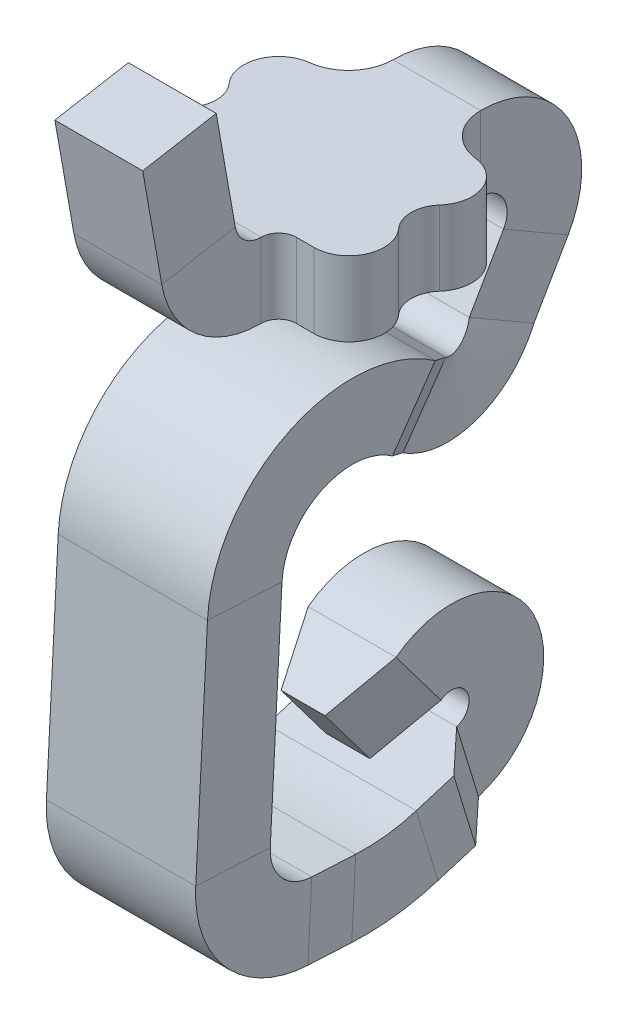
ISO-10303-21;
HEADER;
FILE_DESCRIPTION(('STEP AP214'),'2;1');
FILE_NAME('part.step','',(''),(''),'','','');
FILE_SCHEMA(('AUTOMOTIVE_DESIGN { 1 0 10303 214 1 1 1 1 }'));
ENDSEC;
DATA;
#1=APPLICATION_CONTEXT('core data for automotive mechanical design processes');
#2=APPLICATION_PROTOCOL_DEFINITION('international standard','automotive_design',2000,#1);
#3=PRODUCT_CONTEXT('',#1,'mechanical');
#4=PRODUCT('Part','Part','',(#3));
#5=PRODUCT_RELATED_PRODUCT_CATEGORY('part','',(#4));
#6=PRODUCT_DEFINITION_FORMATION('','',#4);
#7=PRODUCT_DEFINITION_CONTEXT('part definition',#1,'design');
#8=PRODUCT_DEFINITION('design','',#6,#7);
#9=PRODUCT_DEFINITION_SHAPE('','',#8);
#10=(LENGTH_UNIT() NAMED_UNIT(*) SI_UNIT(.MILLI.,.METRE.));
#11=(NAMED_UNIT(*) PLANE_ANGLE_UNIT() SI_UNIT($,.RADIAN.));
#12=(NAMED_UNIT(*) SI_UNIT($,.STERADIAN.) SOLID_ANGLE_UNIT());
#13=UNCERTAINTY_MEASURE_WITH_UNIT(LENGTH_MEASURE(1.E-05),#10,'distance_accuracy_value','');
#14=(GEOMETRIC_REPRESENTATION_CONTEXT(3) GLOBAL_UNCERTAINTY_ASSIGNED_CONTEXT((#13)) GLOBAL_UNIT_ASSIGNED_CONTEXT((#10,
#11,#12)) REPRESENTATION_CONTEXT('',''));
#15=CARTESIAN_POINT('',(0.,0.,0.));
#16=DIRECTION('',(0.,0.,1.));
#17=DIRECTION('',(1.,0.,0.));
#18=AXIS2_PLACEMENT_3D('',#15,#16,#17);
#19=CARTESIAN_POINT('',(0.09,-0.085,-0.0600000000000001));
#20=DIRECTION('',(0.,1.,0.));
#21=DIRECTION('',(0.,0.,1.));
#22=AXIS2_PLACEMENT_3D('',#19,#20,#21);
#23=CYLINDRICAL_SURFACE('',#22,0.04);
#24=CARTESIAN_POINT('',(0.09,0.,-0.0600000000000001));
#25=DIRECTION('',(0.,1.,0.));
#26=DIRECTION('',(0.,0.,1.));
#27=AXIS2_PLACEMENT_3D('',#24,#25,#26);
#28=CIRCLE('',#27,0.04);
#29=CARTESIAN_POINT('',(0.09,0.,-0.02));
#30=VERTEX_POINT('',#29);
#31=CARTESIAN_POINT('',(0.119814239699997,0.,-0.0866666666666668));
#32=VERTEX_POINT('',#31);
#33=EDGE_CURVE('E499',#30,#32,#28,.T.);
#34=ORIENTED_EDGE('',*,*,#33,.F.);
#35=DIRECTION('',(0.,1.,0.));
#36=VECTOR('',#35,1.);
#37=CARTESIAN_POINT('',(0.09,-0.085,-0.02));
#38=LINE('',#37,#36);
#39=CARTESIAN_POINT('',(0.09,-0.085,-0.02));
#40=VERTEX_POINT('',#39);
#41=EDGE_CURVE('E13',#40,#30,#38,.T.);
#42=ORIENTED_EDGE('',*,*,#41,.F.);
#43=CARTESIAN_POINT('',(0.09,-0.085,-0.0600000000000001));
#44=DIRECTION('',(0.,1.,0.));
#45=DIRECTION('',(0.,0.,1.));
#46=AXIS2_PLACEMENT_3D('',#43,#44,#45);
#47=CIRCLE('',#46,0.04);
#48=CARTESIAN_POINT('',(0.119814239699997,-0.085,-0.0866666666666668));
#49=VERTEX_POINT('',#48);
#50=EDGE_CURVE('E508',#40,#49,#47,.T.);
#51=ORIENTED_EDGE('',*,*,#50,.T.);
#52=DIRECTION('',(0.,1.,0.));
#53=VECTOR('',#52,1.);
#54=CARTESIAN_POINT('',(0.119814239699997,-0.085,-0.0866666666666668));
#55=LINE('',#54,#53);
#56=EDGE_CURVE('E170',#49,#32,#55,.T.);
#57=ORIENTED_EDGE('',*,*,#56,.T.);
#58=EDGE_LOOP('',(#34,#42,#51,#57));
#59=FACE_BOUND('',#58,.T.);
#60=ADVANCED_FACE('F167',(#59),#23,.T.);
#61=CARTESIAN_POINT('',(0.07,-0.085,-0.02));
#62=DIRECTION('',(0.,0.,1.));
#63=DIRECTION('',(1.,0.,0.));
#64=AXIS2_PLACEMENT_3D('',#61,#62,#63);
#65=PLANE('',#64);
#66=DIRECTION('',(1.,0.,0.));
#67=VECTOR('',#66,1.);
#68=CARTESIAN_POINT('',(0.07,0.,-0.02));
#69=LINE('',#68,#67);
#70=CARTESIAN_POINT('',(0.07,0.,-0.02));
#71=VERTEX_POINT('',#70);
#72=EDGE_CURVE('E505',#71,#30,#69,.T.);
#73=ORIENTED_EDGE('',*,*,#72,.F.);
#74=DIRECTION('',(0.,1.,0.));
#75=VECTOR('',#74,1.);
#76=CARTESIAN_POINT('',(0.07,-0.085,-0.02));
#77=LINE('',#76,#75);
#78=CARTESIAN_POINT('',(0.07,-0.085,-0.02));
#79=VERTEX_POINT('',#78);
#80=EDGE_CURVE('E176',#79,#71,#77,.T.);
#81=ORIENTED_EDGE('',*,*,#80,.F.);
#82=DIRECTION('',(1.,0.,0.));
#83=VECTOR('',#82,1.);
#84=CARTESIAN_POINT('',(0.07,-0.085,-0.02));
#85=LINE('',#84,#83);
#86=EDGE_CURVE('E537',#79,#40,#85,.T.);
#87=ORIENTED_EDGE('',*,*,#86,.T.);
#88=ORIENTED_EDGE('',*,*,#41,.T.);
#89=EDGE_LOOP('',(#73,#81,#87,#88));
#90=FACE_BOUND('',#89,.T.);
#91=ADVANCED_FACE('F457',(#90),#65,.T.);
#92=CARTESIAN_POINT('',(0.07,-0.085,0.));
#93=DIRECTION('',(0.,1.,0.));
#94=DIRECTION('',(0.,0.,1.));
#95=AXIS2_PLACEMENT_3D('',#92,#93,#94);
#96=CYLINDRICAL_SURFACE('',#95,0.0199999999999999);
#97=CARTESIAN_POINT('',(0.07,0.,0.));
#98=DIRECTION('',(0.,-1.,0.));
#99=DIRECTION('',(0.,0.,1.));
#100=AXIS2_PLACEMENT_3D('',#97,#98,#99);
#101=CIRCLE('',#100,0.0199999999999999);
#102=CARTESIAN_POINT('',(0.0500000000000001,0.,0.));
#103=VERTEX_POINT('',#102);
#104=EDGE_CURVE('E507',#103,#71,#101,.T.);
#105=ORIENTED_EDGE('',*,*,#104,.F.);
#106=DIRECTION('',(0.,1.,0.));
#107=VECTOR('',#106,1.);
#108=CARTESIAN_POINT('',(0.0500000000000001,-0.085,0.));
#109=LINE('',#108,#107);
#110=CARTESIAN_POINT('',(0.0500000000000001,-0.085,0.));
#111=VERTEX_POINT('',#110);
#112=EDGE_CURVE('E301',#111,#103,#109,.T.);
#113=ORIENTED_EDGE('',*,*,#112,.F.);
#114=CARTESIAN_POINT('',(0.07,-0.085,0.));
#115=DIRECTION('',(0.,-1.,0.));
#116=DIRECTION('',(0.,0.,1.));
#117=AXIS2_PLACEMENT_3D('',#114,#115,#116);
#118=CIRCLE('',#117,0.0199999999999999);
#119=EDGE_CURVE('E275',#111,#79,#118,.T.);
#120=ORIENTED_EDGE('',*,*,#119,.T.);
#121=ORIENTED_EDGE('',*,*,#80,.T.);
#122=EDGE_LOOP('',(#105,#113,#120,#121));
#123=FACE_BOUND('',#122,.T.);
#124=ADVANCED_FACE('F460',(#123),#96,.F.);
#125=CARTESIAN_POINT('',(-0.07,-0.085,0.));
#126=DIRECTION('',(0.,1.,0.));
#127=DIRECTION('',(0.,0.,1.));
#128=AXIS2_PLACEMENT_3D('',#125,#126,#127);
#129=CYLINDRICAL_SURFACE('',#128,0.0199999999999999);
#130=CARTESIAN_POINT('',(-0.07,0.,0.));
#131=DIRECTION('',(0.,-1.,0.));
#132=DIRECTION('',(0.,0.,-1.));
#133=AXIS2_PLACEMENT_3D('',#130,#131,#132);
#134=CIRCLE('',#133,0.0199999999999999);
#135=CARTESIAN_POINT('',(-0.07,0.,-0.0199999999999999));
#136=VERTEX_POINT('',#135);
#137=CARTESIAN_POINT('',(-0.0500000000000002,0.,0.));
#138=VERTEX_POINT('',#137);
#139=EDGE_CURVE('E566',#136,#138,#134,.T.);
#140=ORIENTED_EDGE('',*,*,#139,.F.);
#141=DIRECTION('',(0.,1.,0.));
#142=VECTOR('',#141,1.);
#143=CARTESIAN_POINT('',(-0.07,-0.085,-0.0199999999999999));
#144=LINE('',#143,#142);
#145=CARTESIAN_POINT('',(-0.07,-0.085,-0.0199999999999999));
#146=VERTEX_POINT('',#145);
#147=EDGE_CURVE('E288',#146,#136,#144,.T.);
#148=ORIENTED_EDGE('',*,*,#147,.F.);
#149=CARTESIAN_POINT('',(-0.07,-0.085,0.));
#150=DIRECTION('',(0.,-1.,0.));
#151=DIRECTION('',(0.,0.,-1.));
#152=AXIS2_PLACEMENT_3D('',#149,#150,#151);
#153=CIRCLE('',#152,0.0199999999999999);
#154=CARTESIAN_POINT('',(-0.0500000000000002,-0.085,0.));
#155=VERTEX_POINT('',#154);
#156=EDGE_CURVE('E271',#146,#155,#153,.T.);
#157=ORIENTED_EDGE('',*,*,#156,.T.);
#158=DIRECTION('',(0.,1.,0.));
#159=VECTOR('',#158,1.);
#160=CARTESIAN_POINT('',(-0.0500000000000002,-0.085,0.));
#161=LINE('',#160,#159);
#162=EDGE_CURVE('E286',#155,#138,#161,.T.);
#163=ORIENTED_EDGE('',*,*,#162,.T.);
#164=EDGE_LOOP('',(#140,#148,#157,#163));
#165=FACE_BOUND('',#164,.T.);
#166=ADVANCED_FACE('F285',(#165),#129,.F.);
#167=CARTESIAN_POINT('',(-0.07,-0.085,-0.02));
#168=DIRECTION('',(0.,0.,1.));
#169=DIRECTION('',(1.,0.,0.));
#170=AXIS2_PLACEMENT_3D('',#167,#168,#169);
#171=PLANE('',#170);
#172=DIRECTION('',(1.,0.,0.));
#173=VECTOR('',#172,1.);
#174=CARTESIAN_POINT('',(-0.07,0.,-0.02));
#175=LINE('',#174,#173);
#176=CARTESIAN_POINT('',(-0.09,0.,-0.02));
#177=VERTEX_POINT('',#176);
#178=EDGE_CURVE('E563',#177,#136,#175,.T.);
#179=ORIENTED_EDGE('',*,*,#178,.F.);
#180=DIRECTION('',(0.,1.,0.));
#181=VECTOR('',#180,1.);
#182=CARTESIAN_POINT('',(-0.09,-0.085,-0.02));
#183=LINE('',#182,#181);
#184=CARTESIAN_POINT('',(-0.09,-0.085,-0.02));
#185=VERTEX_POINT('',#184);
#186=EDGE_CURVE('E520',#185,#177,#183,.T.);
#187=ORIENTED_EDGE('',*,*,#186,.F.);
#188=DIRECTION('',(1.,0.,0.));
#189=VECTOR('',#188,1.);
#190=CARTESIAN_POINT('',(-0.07,-0.085,-0.02));
#191=LINE('',#190,#189);
#192=EDGE_CURVE('E289',#185,#146,#191,.T.);
#193=ORIENTED_EDGE('',*,*,#192,.T.);
#194=ORIENTED_EDGE('',*,*,#147,.T.);
#195=EDGE_LOOP('',(#179,#187,#193,#194));
#196=FACE_BOUND('',#195,.T.);
#197=ADVANCED_FACE('F465',(#196),#171,.T.);
#198=CARTESIAN_POINT('',(-0.09,-0.085,-0.0600000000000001));
#199=DIRECTION('',(0.,1.,0.));
#200=DIRECTION('',(0.,0.,1.));
#201=AXIS2_PLACEMENT_3D('',#198,#199,#200);
#202=CYLINDRICAL_SURFACE('',#201,0.04);
#203=CARTESIAN_POINT('',(-0.09,0.,-0.0600000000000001));
#204=DIRECTION('',(0.,1.,0.));
#205=DIRECTION('',(0.,0.,-1.));
#206=AXIS2_PLACEMENT_3D('',#203,#204,#205);
#207=CIRCLE('',#206,0.04);
#208=CARTESIAN_POINT('',(-0.119814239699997,0.,-0.0866666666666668));
#209=VERTEX_POINT('',#208);
#210=EDGE_CURVE('E560',#209,#177,#207,.T.);
#211=ORIENTED_EDGE('',*,*,#210,.F.);
#212=DIRECTION('',(0.,1.,0.));
#213=VECTOR('',#212,1.);
#214=CARTESIAN_POINT('',(-0.119814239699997,-0.085,-0.0866666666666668));
#215=LINE('',#214,#213);
#216=CARTESIAN_POINT('',(-0.119814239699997,-0.085,-0.0866666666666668));
#217=VERTEX_POINT('',#216);
#218=EDGE_CURVE('E522',#217,#209,#215,.T.);
#219=ORIENTED_EDGE('',*,*,#218,.F.);
#220=CARTESIAN_POINT('',(-0.09,-0.085,-0.0600000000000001));
#221=DIRECTION('',(0.,1.,0.));
#222=DIRECTION('',(0.,0.,-1.));
#223=AXIS2_PLACEMENT_3D('',#220,#221,#222);
#224=CIRCLE('',#223,0.04);
#225=EDGE_CURVE('E1061',#217,#185,#224,.T.);
#226=ORIENTED_EDGE('',*,*,#225,.T.);
#227=ORIENTED_EDGE('',*,*,#186,.T.);
#228=EDGE_LOOP('',(#211,#219,#226,#227));
#229=FACE_BOUND('',#228,.T.);
#230=ADVANCED_FACE('F468',(#229),#202,.T.);
#231=CARTESIAN_POINT('',(-0.145901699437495,-0.085,-0.11));
#232=DIRECTION('',(0.,1.,0.));
#233=DIRECTION('',(0.,0.,1.));
#234=AXIS2_PLACEMENT_3D('',#231,#232,#233);
#235=CYLINDRICAL_SURFACE('',#234,0.035);
#236=CARTESIAN_POINT('',(-0.145901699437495,0.,-0.11));
#237=DIRECTION('',(0.,-1.,0.));
#238=DIRECTION('',(0.,0.,1.));
#239=AXIS2_PLACEMENT_3D('',#236,#237,#238);
#240=CIRCLE('',#239,0.035);
#241=CARTESIAN_POINT('',(-0.119814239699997,0.,-0.133333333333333));
#242=VERTEX_POINT('',#241);
#243=EDGE_CURVE('E557',#242,#209,#240,.T.);
#244=ORIENTED_EDGE('',*,*,#243,.F.);
#245=DIRECTION('',(0.,1.,0.));
#246=VECTOR('',#245,1.);
#247=CARTESIAN_POINT('',(-0.119814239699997,-0.085,-0.133333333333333));
#248=LINE('',#247,#246);
#249=CARTESIAN_POINT('',(-0.119814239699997,-0.085,-0.133333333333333));
#250=VERTEX_POINT('',#249);
#251=EDGE_CURVE('E524',#250,#242,#248,.T.);
#252=ORIENTED_EDGE('',*,*,#251,.F.);
#253=CARTESIAN_POINT('',(-0.145901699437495,-0.085,-0.11));
#254=DIRECTION('',(0.,-1.,0.));
#255=DIRECTION('',(0.,0.,1.));
#256=AXIS2_PLACEMENT_3D('',#253,#254,#255);
#257=CIRCLE('',#256,0.035);
#258=EDGE_CURVE('E1058',#250,#217,#257,.T.);
#259=ORIENTED_EDGE('',*,*,#258,.T.);
#260=ORIENTED_EDGE('',*,*,#218,.T.);
#261=EDGE_LOOP('',(#244,#252,#259,#260));
#262=FACE_BOUND('',#261,.T.);
#263=ADVANCED_FACE('F472',(#262),#235,.F.);
#264=CARTESIAN_POINT('',(-0.09,-0.085,-0.16));
#265=DIRECTION('',(0.,1.,0.));
#266=DIRECTION('',(0.,0.,1.));
#267=AXIS2_PLACEMENT_3D('',#264,#265,#266);
#268=CYLINDRICAL_SURFACE('',#267,0.04);
#269=CARTESIAN_POINT('',(-0.09,0.,-0.16));
#270=DIRECTION('',(0.,1.,0.));
#271=DIRECTION('',(0.,0.,-1.));
#272=AXIS2_PLACEMENT_3D('',#269,#270,#271);
#273=CIRCLE('',#272,0.04);
#274=CARTESIAN_POINT('',(-0.0946896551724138,0.,-0.199724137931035));
#275=VERTEX_POINT('',#274);
#276=EDGE_CURVE('E554',#275,#242,#273,.T.);
#277=ORIENTED_EDGE('',*,*,#276,.F.);
#278=DIRECTION('',(0.,1.,0.));
#279=VECTOR('',#278,1.);
#280=CARTESIAN_POINT('',(-0.0946896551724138,-0.085,-0.199724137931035));
#281=LINE('',#280,#279);
#282=CARTESIAN_POINT('',(-0.0946896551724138,-0.085,-0.199724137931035));
#283=VERTEX_POINT('',#282);
#284=EDGE_CURVE('E526',#283,#275,#281,.T.);
#285=ORIENTED_EDGE('',*,*,#284,.F.);
#286=CARTESIAN_POINT('',(-0.09,-0.085,-0.16));
#287=DIRECTION('',(0.,1.,0.));
#288=DIRECTION('',(0.,0.,-1.));
#289=AXIS2_PLACEMENT_3D('',#286,#287,#288);
#290=CIRCLE('',#289,0.04);
#291=EDGE_CURVE('E1055',#283,#250,#290,.T.);
#292=ORIENTED_EDGE('',*,*,#291,.T.);
#293=ORIENTED_EDGE('',*,*,#251,.T.);
#294=EDGE_LOOP('',(#277,#285,#292,#293));
#295=FACE_BOUND('',#294,.T.);
#296=ADVANCED_FACE('F476',(#295),#268,.T.);
#297=CARTESIAN_POINT('',(-0.100625,-0.085,-0.25));
#298=DIRECTION('',(0.,1.,0.));
#299=DIRECTION('',(0.,0.,1.));
#300=AXIS2_PLACEMENT_3D('',#297,#298,#299);
#301=CYLINDRICAL_SURFACE('',#300,0.050625);
#302=CARTESIAN_POINT('',(-0.100625,0.,-0.25));
#303=DIRECTION('',(0.,-1.,0.));
#304=DIRECTION('',(0.,0.,1.));
#305=AXIS2_PLACEMENT_3D('',#302,#303,#304);
#306=CIRCLE('',#305,0.050625);
#307=CARTESIAN_POINT('',(-0.05,0.,-0.25));
#308=VERTEX_POINT('',#307);
#309=EDGE_CURVE('E551',#308,#275,#306,.T.);
#310=ORIENTED_EDGE('',*,*,#309,.F.);
#311=DIRECTION('',(0.,1.,0.));
#312=VECTOR('',#311,1.);
#313=CARTESIAN_POINT('',(-0.05,-0.085,-0.25));
#314=LINE('',#313,#312);
#315=CARTESIAN_POINT('',(-0.05,-0.085,-0.25));
#316=VERTEX_POINT('',#315);
#317=EDGE_CURVE('E528',#316,#308,#314,.T.);
#318=ORIENTED_EDGE('',*,*,#317,.F.);
#319=CARTESIAN_POINT('',(-0.100625,-0.085,-0.25));
#320=DIRECTION('',(0.,-1.,0.));
#321=DIRECTION('',(0.,0.,1.));
#322=AXIS2_PLACEMENT_3D('',#319,#320,#321);
#323=CIRCLE('',#322,0.050625);
#324=EDGE_CURVE('E1052',#316,#283,#323,.T.);
#325=ORIENTED_EDGE('',*,*,#324,.T.);
#326=ORIENTED_EDGE('',*,*,#284,.T.);
#327=EDGE_LOOP('',(#310,#318,#325,#326));
#328=FACE_BOUND('',#327,.T.);
#329=ADVANCED_FACE('F480',(#328),#301,.F.);
#330=CARTESIAN_POINT('',(0.100625,-0.085,-0.25));
#331=DIRECTION('',(0.,1.,0.));
#332=DIRECTION('',(0.,0.,1.));
#333=AXIS2_PLACEMENT_3D('',#330,#331,#332);
#334=CYLINDRICAL_SURFACE('',#333,0.050625);
#335=CARTESIAN_POINT('',(0.100625,0.,-0.25));
#336=DIRECTION('',(0.,-1.,0.));
#337=DIRECTION('',(0.,0.,-1.));
#338=AXIS2_PLACEMENT_3D('',#335,#336,#337);
#339=CIRCLE('',#338,0.050625);
#340=CARTESIAN_POINT('',(0.0946896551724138,0.,-0.199724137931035));
#341=VERTEX_POINT('',#340);
#342=CARTESIAN_POINT('',(0.05,0.,-0.25));
#343=VERTEX_POINT('',#342);
#344=EDGE_CURVE('E545',#341,#343,#339,.T.);
#345=ORIENTED_EDGE('',*,*,#344,.F.);
#346=DIRECTION('',(0.,1.,0.));
#347=VECTOR('',#346,1.);
#348=CARTESIAN_POINT('',(0.0946896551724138,-0.085,-0.199724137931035));
#349=LINE('',#348,#347);
#350=CARTESIAN_POINT('',(0.0946896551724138,-0.085,-0.199724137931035));
#351=VERTEX_POINT('',#350);
#352=EDGE_CURVE('E534',#351,#341,#349,.T.);
#353=ORIENTED_EDGE('',*,*,#352,.F.);
#354=CARTESIAN_POINT('',(0.100625,-0.085,-0.25));
#355=DIRECTION('',(0.,-1.,0.));
#356=DIRECTION('',(0.,0.,-1.));
#357=AXIS2_PLACEMENT_3D('',#354,#355,#356);
#358=CIRCLE('',#357,0.050625);
#359=CARTESIAN_POINT('',(0.05,-0.085,-0.25));
#360=VERTEX_POINT('',#359);
#361=EDGE_CURVE('E1047',#351,#360,#358,.T.);
#362=ORIENTED_EDGE('',*,*,#361,.T.);
#363=DIRECTION('',(0.,1.,0.));
#364=VECTOR('',#363,1.);
#365=CARTESIAN_POINT('',(0.05,-0.085,-0.25));
#366=LINE('',#365,#364);
#367=EDGE_CURVE('E531',#360,#343,#366,.T.);
#368=ORIENTED_EDGE('',*,*,#367,.T.);
#369=EDGE_LOOP('',(#345,#353,#362,#368));
#370=FACE_BOUND('',#369,.T.);
#371=ADVANCED_FACE('F484',(#370),#334,.F.);
#372=CARTESIAN_POINT('',(0.09,-0.085,-0.16));
#373=DIRECTION('',(0.,1.,0.));
#374=DIRECTION('',(0.,0.,1.));
#375=AXIS2_PLACEMENT_3D('',#372,#373,#374);
#376=CYLINDRICAL_SURFACE('',#375,0.04);
#377=CARTESIAN_POINT('',(0.09,0.,-0.16));
#378=DIRECTION('',(0.,1.,0.));
#379=DIRECTION('',(0.,0.,1.));
#380=AXIS2_PLACEMENT_3D('',#377,#378,#379);
#381=CIRCLE('',#380,0.04);
#382=CARTESIAN_POINT('',(0.119814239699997,0.,-0.133333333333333));
#383=VERTEX_POINT('',#382);
#384=EDGE_CURVE('E542',#383,#341,#381,.T.);
#385=ORIENTED_EDGE('',*,*,#384,.F.);
#386=DIRECTION('',(0.,1.,0.));
#387=VECTOR('',#386,1.);
#388=CARTESIAN_POINT('',(0.119814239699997,-0.085,-0.133333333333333));
#389=LINE('',#388,#387);
#390=CARTESIAN_POINT('',(0.119814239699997,-0.085,-0.133333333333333));
#391=VERTEX_POINT('',#390);
#392=EDGE_CURVE('E535',#391,#383,#389,.T.);
#393=ORIENTED_EDGE('',*,*,#392,.F.);
#394=CARTESIAN_POINT('',(0.09,-0.085,-0.16));
#395=DIRECTION('',(0.,1.,0.));
#396=DIRECTION('',(0.,0.,1.));
#397=AXIS2_PLACEMENT_3D('',#394,#395,#396);
#398=CIRCLE('',#397,0.04);
#399=EDGE_CURVE('E1044',#391,#351,#398,.T.);
#400=ORIENTED_EDGE('',*,*,#399,.T.);
#401=ORIENTED_EDGE('',*,*,#352,.T.);
#402=EDGE_LOOP('',(#385,#393,#400,#401));
#403=FACE_BOUND('',#402,.T.);
#404=ADVANCED_FACE('F488',(#403),#376,.T.);
#405=CARTESIAN_POINT('',(0.145901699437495,-0.085,-0.11));
#406=DIRECTION('',(0.,1.,0.));
#407=DIRECTION('',(0.,0.,1.));
#408=AXIS2_PLACEMENT_3D('',#405,#406,#407);
#409=CYLINDRICAL_SURFACE('',#408,0.035);
#410=CARTESIAN_POINT('',(0.145901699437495,0.,-0.11));
#411=DIRECTION('',(0.,-1.,0.));
#412=DIRECTION('',(0.,0.,-1.));
#413=AXIS2_PLACEMENT_3D('',#410,#411,#412);
#414=CIRCLE('',#413,0.035);
#415=EDGE_CURVE('E502',#32,#383,#414,.T.);
#416=ORIENTED_EDGE('',*,*,#415,.F.);
#417=ORIENTED_EDGE('',*,*,#56,.F.);
#418=CARTESIAN_POINT('',(0.145901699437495,-0.085,-0.11));
#419=DIRECTION('',(0.,-1.,0.));
#420=DIRECTION('',(0.,0.,-1.));
#421=AXIS2_PLACEMENT_3D('',#418,#419,#420);
#422=CIRCLE('',#421,0.035);
#423=EDGE_CURVE('E510',#49,#391,#422,.T.);
#424=ORIENTED_EDGE('',*,*,#423,.T.);
#425=ORIENTED_EDGE('',*,*,#392,.T.);
#426=EDGE_LOOP('',(#416,#417,#424,#425));
#427=FACE_BOUND('',#426,.T.);
#428=ADVANCED_FACE('F453',(#427),#409,.F.);
#429=CARTESIAN_POINT('',(0.09,-0.085,-0.0600000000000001));
#430=DIRECTION('',(0.,1.,0.));
#431=DIRECTION('',(0.,0.,1.));
#432=AXIS2_PLACEMENT_3D('',#429,#430,#431);
#433=PLANE('',#432);
#434=ORIENTED_EDGE('',*,*,#50,.F.);
#435=ORIENTED_EDGE('',*,*,#86,.F.);
#436=ORIENTED_EDGE('',*,*,#119,.F.);
#437=DIRECTION('',(1.,0.,0.));
#438=VECTOR('',#437,1.);
#439=CARTESIAN_POINT('',(0.0500000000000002,-0.085,0.));
#440=LINE('',#439,#438);
#441=EDGE_CURVE('E267',#155,#111,#440,.T.);
#442=ORIENTED_EDGE('',*,*,#441,.F.);
#443=ORIENTED_EDGE('',*,*,#156,.F.);
#444=ORIENTED_EDGE('',*,*,#192,.F.);
#445=ORIENTED_EDGE('',*,*,#225,.F.);
#446=ORIENTED_EDGE('',*,*,#258,.F.);
#447=ORIENTED_EDGE('',*,*,#291,.F.);
#448=ORIENTED_EDGE('',*,*,#324,.F.);
#449=DIRECTION('',(-1.,0.,0.));
#450=VECTOR('',#449,1.);
#451=CARTESIAN_POINT('',(0.05,-0.085,-0.25));
#452=LINE('',#451,#450);
#453=EDGE_CURVE('E1050',#360,#316,#452,.T.);
#454=ORIENTED_EDGE('',*,*,#453,.F.);
#455=ORIENTED_EDGE('',*,*,#361,.F.);
#456=ORIENTED_EDGE('',*,*,#399,.F.);
#457=ORIENTED_EDGE('',*,*,#423,.F.);
#458=EDGE_LOOP('',(#434,#435,#436,#442,#443,#444,#445,#446,#447,#448,#454,#455,#456,#457));
#459=FACE_BOUND('',#458,.T.);
#460=ADVANCED_FACE('F269',(#459),#433,.F.);
#461=CARTESIAN_POINT('',(0.09,0.,-0.0600000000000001));
#462=DIRECTION('',(0.,1.,0.));
#463=DIRECTION('',(0.,0.,1.));
#464=AXIS2_PLACEMENT_3D('',#461,#462,#463);
#465=PLANE('',#464);
#466=ORIENTED_EDGE('',*,*,#33,.T.);
#467=ORIENTED_EDGE('',*,*,#415,.T.);
#468=ORIENTED_EDGE('',*,*,#384,.T.);
#469=ORIENTED_EDGE('',*,*,#344,.T.);
#470=DIRECTION('',(-1.,0.,0.));
#471=VECTOR('',#470,1.);
#472=CARTESIAN_POINT('',(0.05,0.,-0.25));
#473=LINE('',#472,#471);
#474=EDGE_CURVE('E548',#343,#308,#473,.T.);
#475=ORIENTED_EDGE('',*,*,#474,.T.);
#476=ORIENTED_EDGE('',*,*,#309,.T.);
#477=ORIENTED_EDGE('',*,*,#276,.T.);
#478=ORIENTED_EDGE('',*,*,#243,.T.);
#479=ORIENTED_EDGE('',*,*,#210,.T.);
#480=ORIENTED_EDGE('',*,*,#178,.T.);
#481=ORIENTED_EDGE('',*,*,#139,.T.);
#482=DIRECTION('',(1.,0.,0.));
#483=VECTOR('',#482,1.);
#484=CARTESIAN_POINT('',(0.0500000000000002,0.,0.));
#485=LINE('',#484,#483);
#486=EDGE_CURVE('E512',#138,#103,#485,.T.);
#487=ORIENTED_EDGE('',*,*,#486,.T.);
#488=ORIENTED_EDGE('',*,*,#104,.T.);
#489=ORIENTED_EDGE('',*,*,#72,.T.);
#490=EDGE_LOOP('',(#466,#467,#468,#469,#475,#476,#477,#478,#479,#480,#481,#487,#488,#489));
#491=FACE_BOUND('',#490,.T.);
#492=ADVANCED_FACE('F446',(#491),#465,.T.);
#493=CARTESIAN_POINT('',(-0.05,-0.115,-0.25));
#494=DIRECTION('',(-1.,0.,0.));
#495=DIRECTION('',(0.,0.,1.));
#496=AXIS2_PLACEMENT_3D('',#493,#494,#495);
#497=PLANE('',#496);
#498=DIRECTION('',(0.,0.499999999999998,0.86602540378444));
#499=VECTOR('',#498,1.);
#500=CARTESIAN_POINT('',(-0.05,-0.1725,-0.349592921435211));
#501=LINE('',#500,#499);
#502=CARTESIAN_POINT('',(-0.05,-0.13,-0.275980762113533));
#503=VERTEX_POINT('',#502);
#504=CARTESIAN_POINT('',(-0.05,-0.1725,-0.349592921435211));
#505=VERTEX_POINT('',#504);
#506=EDGE_CURVE('E365',#503,#505,#501,.F.);
#507=ORIENTED_EDGE('',*,*,#506,.F.);
#508=CARTESIAN_POINT('',(-0.05,-0.115,-0.25));
#509=DIRECTION('',(1.,0.,0.));
#510=DIRECTION('',(0.,0.,-1.));
#511=AXIS2_PLACEMENT_3D('',#508,#509,#510);
#512=CIRCLE('',#511,0.03);
#513=EDGE_CURVE('E1011',#316,#503,#512,.F.);
#514=ORIENTED_EDGE('',*,*,#513,.F.);
#515=ORIENTED_EDGE('',*,*,#317,.T.);
#516=CARTESIAN_POINT('',(-0.05,-0.115,-0.25));
#517=DIRECTION('',(1.,0.,0.));
#518=DIRECTION('',(0.,0.,-1.));
#519=AXIS2_PLACEMENT_3D('',#516,#517,#518);
#520=CIRCLE('',#519,0.115);
#521=EDGE_CURVE('E503',#308,#505,#520,.F.);
#522=ORIENTED_EDGE('',*,*,#521,.T.);
#523=EDGE_LOOP('',(#507,#514,#515,#522));
#524=FACE_BOUND('',#523,.T.);
#525=ADVANCED_FACE('F443',(#524),#497,.T.);
#526=CARTESIAN_POINT('',(0.05,-0.115,-0.25));
#527=DIRECTION('',(-1.,0.,0.));
#528=DIRECTION('',(0.,0.,1.));
#529=AXIS2_PLACEMENT_3D('',#526,#527,#528);
#530=PLANE('',#529);
#531=CARTESIAN_POINT('',(0.05,-0.115,-0.25));
#532=DIRECTION('',(1.,0.,0.));
#533=DIRECTION('',(0.,0.,-1.));
#534=AXIS2_PLACEMENT_3D('',#531,#532,#533);
#535=CIRCLE('',#534,0.03);
#536=CARTESIAN_POINT('',(0.05,-0.13,-0.275980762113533));
#537=VERTEX_POINT('',#536);
#538=EDGE_CURVE('E1009',#537,#360,#535,.T.);
#539=ORIENTED_EDGE('',*,*,#538,.F.);
#540=DIRECTION('',(0.,0.499999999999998,0.86602540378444));
#541=VECTOR('',#540,1.);
#542=CARTESIAN_POINT('',(0.05,-0.13,-0.275980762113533));
#543=LINE('',#542,#541);
#544=CARTESIAN_POINT('',(0.05,-0.1725,-0.349592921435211));
#545=VERTEX_POINT('',#544);
#546=EDGE_CURVE('E1015',#537,#545,#543,.F.);
#547=ORIENTED_EDGE('',*,*,#546,.T.);
#548=CARTESIAN_POINT('',(0.05,-0.115,-0.25));
#549=DIRECTION('',(1.,0.,0.));
#550=DIRECTION('',(0.,0.,-1.));
#551=AXIS2_PLACEMENT_3D('',#548,#549,#550);
#552=CIRCLE('',#551,0.115);
#553=EDGE_CURVE('E1040',#545,#343,#552,.T.);
#554=ORIENTED_EDGE('',*,*,#553,.T.);
#555=ORIENTED_EDGE('',*,*,#367,.F.);
#556=EDGE_LOOP('',(#539,#547,#554,#555));
#557=FACE_BOUND('',#556,.T.);
#558=ADVANCED_FACE('F438',(#557),#530,.F.);
#559=CARTESIAN_POINT('',(0.05,-0.115,-0.25));
#560=DIRECTION('',(1.,0.,0.));
#561=DIRECTION('',(0.,-0.499999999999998,-0.86602540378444));
#562=AXIS2_PLACEMENT_3D('',#559,#560,#561);
#563=CYLINDRICAL_SURFACE('',#562,0.115);
#564=ORIENTED_EDGE('',*,*,#474,.F.);
#565=ORIENTED_EDGE('',*,*,#553,.F.);
#566=DIRECTION('',(1.,0.,0.));
#567=VECTOR('',#566,1.);
#568=CARTESIAN_POINT('',(-0.05,-0.1725,-0.349592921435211));
#569=LINE('',#568,#567);
#570=EDGE_CURVE('E1029',#545,#505,#569,.F.);
#571=ORIENTED_EDGE('',*,*,#570,.T.);
#572=ORIENTED_EDGE('',*,*,#521,.F.);
#573=EDGE_LOOP('',(#564,#565,#571,#572));
#574=FACE_BOUND('',#573,.T.);
#575=ADVANCED_FACE('F435',(#574),#563,.T.);
#576=CARTESIAN_POINT('',(0.05,-0.115,-0.25));
#577=DIRECTION('',(1.,0.,0.));
#578=DIRECTION('',(0.,-0.499999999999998,-0.86602540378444));
#579=AXIS2_PLACEMENT_3D('',#576,#577,#578);
#580=CYLINDRICAL_SURFACE('',#579,0.03);
#581=ORIENTED_EDGE('',*,*,#453,.T.);
#582=ORIENTED_EDGE('',*,*,#513,.T.);
#583=DIRECTION('',(1.,0.,0.));
#584=VECTOR('',#583,1.);
#585=CARTESIAN_POINT('',(-0.05,-0.13,-0.275980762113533));
#586=LINE('',#585,#584);
#587=EDGE_CURVE('E1007',#503,#537,#586,.T.);
#588=ORIENTED_EDGE('',*,*,#587,.T.);
#589=ORIENTED_EDGE('',*,*,#538,.T.);
#590=EDGE_LOOP('',(#581,#582,#588,#589));
#591=FACE_BOUND('',#590,.T.);
#592=ADVANCED_FACE('F433',(#591),#580,.F.);
#593=CARTESIAN_POINT('',(0.05,-0.240083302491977,-0.310573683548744));
#594=DIRECTION('',(-1.,0.,0.));
#595=DIRECTION('',(0.,-1.,0.));
#596=AXIS2_PLACEMENT_3D('',#593,#594,#595);
#597=PLANE('',#596);
#598=ORIENTED_EDGE('',*,*,#546,.F.);
#599=DIRECTION('',(0.,0.86602540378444,-0.499999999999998));
#600=VECTOR('',#599,1.);
#601=CARTESIAN_POINT('',(0.05,-0.197583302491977,-0.236961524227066));
#602=LINE('',#601,#600);
#603=CARTESIAN_POINT('',(0.05,-0.197583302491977,-0.236961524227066));
#604=VERTEX_POINT('',#603);
#605=EDGE_CURVE('E1025',#537,#604,#602,.F.);
#606=ORIENTED_EDGE('',*,*,#605,.T.);
#607=DIRECTION('',(0.,0.499999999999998,0.86602540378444));
#608=VECTOR('',#607,1.);
#609=CARTESIAN_POINT('',(0.05,-0.240083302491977,-0.310573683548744));
#610=LINE('',#609,#608);
#611=CARTESIAN_POINT('',(0.05,-0.240083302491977,-0.310573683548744));
#612=VERTEX_POINT('',#611);
#613=EDGE_CURVE('E404',#612,#604,#610,.T.);
#614=ORIENTED_EDGE('',*,*,#613,.F.);
#615=DIRECTION('',(0.,-0.86602540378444,0.499999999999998));
#616=VECTOR('',#615,1.);
#617=CARTESIAN_POINT('',(0.05,-0.172003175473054,-0.349879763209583));
#618=LINE('',#617,#616);
#619=EDGE_CURVE('E1028',#545,#612,#618,.T.);
#620=ORIENTED_EDGE('',*,*,#619,.F.);
#621=EDGE_LOOP('',(#598,#606,#614,#620));
#622=FACE_BOUND('',#621,.T.);
#623=ADVANCED_FACE('F429',(#622),#597,.F.);
#624=CARTESIAN_POINT('',(-0.05,-0.1275,-0.375573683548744));
#625=DIRECTION('',(1.,0.,0.));
#626=DIRECTION('',(0.,0.,-1.));
#627=AXIS2_PLACEMENT_3D('',#624,#625,#626);
#628=PLANE('',#627);
#629=ORIENTED_EDGE('',*,*,#506,.T.);
#630=DIRECTION('',(0.,0.86602540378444,-0.499999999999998));
#631=VECTOR('',#630,1.);
#632=CARTESIAN_POINT('',(-0.05,-0.172003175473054,-0.349879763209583));
#633=LINE('',#632,#631);
#634=CARTESIAN_POINT('',(-0.05,-0.240083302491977,-0.310573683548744));
#635=VERTEX_POINT('',#634);
#636=EDGE_CURVE('E1080',#635,#505,#633,.T.);
#637=ORIENTED_EDGE('',*,*,#636,.F.);
#638=DIRECTION('',(0.,0.499999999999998,0.86602540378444));
#639=VECTOR('',#638,1.);
#640=CARTESIAN_POINT('',(-0.05,-0.240083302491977,-0.310573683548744));
#641=LINE('',#640,#639);
#642=CARTESIAN_POINT('',(-0.05,-0.197583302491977,-0.236961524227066));
#643=VERTEX_POINT('',#642);
#644=EDGE_CURVE('E1083',#635,#643,#641,.T.);
#645=ORIENTED_EDGE('',*,*,#644,.T.);
#646=DIRECTION('',(0.,-0.86602540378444,0.499999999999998));
#647=VECTOR('',#646,1.);
#648=CARTESIAN_POINT('',(-0.05,-0.085,-0.301961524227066));
#649=LINE('',#648,#647);
#650=EDGE_CURVE('E1033',#643,#503,#649,.F.);
#651=ORIENTED_EDGE('',*,*,#650,.T.);
#652=EDGE_LOOP('',(#629,#637,#645,#651));
#653=FACE_BOUND('',#652,.T.);
#654=ADVANCED_FACE('F422',(#653),#628,.F.);
#655=CARTESIAN_POINT('',(0.,-0.172003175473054,-0.349879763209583));
#656=DIRECTION('',(0.,0.499999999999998,0.86602540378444));
#657=DIRECTION('',(0.,-0.86602540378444,0.499999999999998));
#658=AXIS2_PLACEMENT_3D('',#655,#656,#657);
#659=PLANE('',#658);
#660=ORIENTED_EDGE('',*,*,#570,.F.);
#661=ORIENTED_EDGE('',*,*,#619,.T.);
#662=DIRECTION('',(-1.,0.,0.));
#663=VECTOR('',#662,1.);
#664=CARTESIAN_POINT('',(0.,-0.240083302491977,-0.310573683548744));
#665=LINE('',#664,#663);
#666=EDGE_CURVE('E1082',#612,#635,#665,.T.);
#667=ORIENTED_EDGE('',*,*,#666,.T.);
#668=ORIENTED_EDGE('',*,*,#636,.T.);
#669=EDGE_LOOP('',(#660,#661,#667,#668));
#670=FACE_BOUND('',#669,.T.);
#671=ADVANCED_FACE('F412',(#670),#659,.F.);
#672=CARTESIAN_POINT('',(0.,-0.129503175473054,-0.276267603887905));
#673=DIRECTION('',(0.,0.499999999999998,0.86602540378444));
#674=DIRECTION('',(0.,-0.86602540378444,0.499999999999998));
#675=AXIS2_PLACEMENT_3D('',#672,#673,#674);
#676=PLANE('',#675);
#677=ORIENTED_EDGE('',*,*,#605,.F.);
#678=ORIENTED_EDGE('',*,*,#587,.F.);
#679=ORIENTED_EDGE('',*,*,#650,.F.);
#680=DIRECTION('',(1.,0.,0.));
#681=VECTOR('',#680,1.);
#682=CARTESIAN_POINT('',(-0.05,-0.197583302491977,-0.236961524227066));
#683=LINE('',#682,#681);
#684=EDGE_CURVE('E1031',#604,#643,#683,.F.);
#685=ORIENTED_EDGE('',*,*,#684,.F.);
#686=EDGE_LOOP('',(#677,#678,#679,#685));
#687=FACE_BOUND('',#686,.T.);
#688=ADVANCED_FACE('F421',(#687),#676,.T.);
#689=CARTESIAN_POINT('',(-0.05,-0.240508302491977,-0.311309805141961));
#690=CARTESIAN_POINT('',(-0.0527376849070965,-0.268329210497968,-0.295247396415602));
#691=CARTESIAN_POINT('',(-0.0554565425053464,-0.288758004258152,-0.267310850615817));
#692=CARTESIAN_POINT('',(-0.0609130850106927,-0.302616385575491,-0.204799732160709));
#693=CARTESIAN_POINT('',(-0.0636319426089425,-0.295908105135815,-0.170847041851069));
#694=CARTESIAN_POINT('',(-0.066369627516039,-0.277482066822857,-0.144531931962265));
#695=CARTESIAN_POINT('',(-0.05,-0.240083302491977,-0.310573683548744));
#696=CARTESIAN_POINT('',(-0.052737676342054,-0.26770006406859,-0.294629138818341));
#697=CARTESIAN_POINT('',(-0.0554565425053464,-0.287978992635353,-0.266897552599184));
#698=CARTESIAN_POINT('',(-0.0609130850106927,-0.301735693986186,-0.204845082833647));
#699=CARTESIAN_POINT('',(-0.0636319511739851,-0.29507661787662,-0.171141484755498));
#700=CARTESIAN_POINT('',(-0.066369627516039,-0.276785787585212,-0.145019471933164));
#701=CARTESIAN_POINT('',(-0.05,-0.197583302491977,-0.236961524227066));
#702=CARTESIAN_POINT('',(-0.0527368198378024,-0.204785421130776,-0.232803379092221));
#703=CARTESIAN_POINT('',(-0.0554565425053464,-0.210077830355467,-0.225567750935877));
#704=CARTESIAN_POINT('',(-0.0609130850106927,-0.213666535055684,-0.209380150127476));
#705=CARTESIAN_POINT('',(-0.0636328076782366,-0.211927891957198,-0.200585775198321));
#706=CARTESIAN_POINT('',(-0.066369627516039,-0.207157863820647,-0.193773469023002));
#707=CARTESIAN_POINT('',(-0.05,-0.197154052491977,-0.236218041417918));
#708=CARTESIAN_POINT('',(-0.0527368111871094,-0.204149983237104,-0.232178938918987));
#709=CARTESIAN_POINT('',(-0.0554565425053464,-0.20929102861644,-0.225150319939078));
#710=CARTESIAN_POINT('',(-0.0609130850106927,-0.212777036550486,-0.209425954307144));
#711=CARTESIAN_POINT('',(-0.0636328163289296,-0.211088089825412,-0.200883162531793));
#712=CARTESIAN_POINT('',(-0.066369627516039,-0.206454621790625,-0.194265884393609));
#713=B_SPLINE_SURFACE_WITH_KNOTS('',1,3,((#689,#690,#691,#692,#693,#694),(#695,#696,#697,#698,
#699,#700),(#701,#702,#703,#704,#705,#706),(#707,#708,#709,#710,#711,#712)),.UNSPECIFIED.,.F.,
.F.,.F.,(2,1,1,2),(4,2,4),(-0.01,0.,1.,1.0101),(0.,0.5,1.),.UNSPECIFIED.);
#714=DIRECTION('',(0.,0.819152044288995,-0.573576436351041));
#715=VECTOR('',#714,1.);
#716=CARTESIAN_POINT('',(-0.066369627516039,-0.276785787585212,-0.145019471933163));
#717=LINE('',#716,#715);
#718=CARTESIAN_POINT('',(-0.066369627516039,-0.207157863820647,-0.193773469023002));
#719=VERTEX_POINT('',#718);
#720=CARTESIAN_POINT('',(-0.066369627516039,-0.276785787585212,-0.145019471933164));
#721=VERTEX_POINT('',#720);
#722=EDGE_CURVE('E307',#719,#721,#717,.F.);
#723=CARTESIAN_POINT('',(-0.05,-0.197583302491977,-0.236961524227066));
#724=CARTESIAN_POINT('',(-0.0511709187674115,-0.200683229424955,-0.235203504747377));
#725=CARTESIAN_POINT('',(-0.0523403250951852,-0.203425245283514,-0.232860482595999));
#726=CARTESIAN_POINT('',(-0.054678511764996,-0.207946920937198,-0.227376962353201));
#727=CARTESIAN_POINT('',(-0.0558472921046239,-0.209726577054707,-0.224236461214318));
#728=CARTESIAN_POINT('',(-0.0581861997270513,-0.212076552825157,-0.217531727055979));
#729=CARTESIAN_POINT('',(-0.0593563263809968,-0.212647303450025,-0.213967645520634));
#730=CARTESIAN_POINT('',(-0.0616952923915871,-0.212508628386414,-0.2068622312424));
#731=CARTESIAN_POINT('',(-0.0628641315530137,-0.21179902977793,-0.203320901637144));
#732=CARTESIAN_POINT('',(-0.0648116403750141,-0.209644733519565,-0.197807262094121));
#733=CARTESIAN_POINT('',(-0.0655909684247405,-0.20852244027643,-0.195704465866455));
#734=CARTESIAN_POINT('',(-0.066369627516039,-0.207157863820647,-0.193773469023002));
#735=B_SPLINE_CURVE_WITH_KNOTS('',3,(#723,#724,#725,#726,#727,#728,#729,#730,#731,#732,#733,
#734),.UNSPECIFIED.,.F.,.F.,(4,2,2,2,2,4),(0.,0.0111711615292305,0.0223423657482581,
0.0335095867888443,0.0446783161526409,0.0521377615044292),.UNSPECIFIED.);
#736=EDGE_CURVE('E392',#643,#719,#735,.T.);
#737=CARTESIAN_POINT('',(-0.05,-0.240083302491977,-0.310573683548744));
#738=CARTESIAN_POINT('',(-0.0506475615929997,-0.246607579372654,-0.306810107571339));
#739=CARTESIAN_POINT('',(-0.0512932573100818,-0.25274590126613,-0.302406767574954));
#740=CARTESIAN_POINT('',(-0.0525824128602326,-0.264038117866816,-0.292506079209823));
#741=CARTESIAN_POINT('',(-0.0532258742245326,-0.269194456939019,-0.287011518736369));
#742=CARTESIAN_POINT('',(-0.0549823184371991,-0.281659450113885,-0.270776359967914));
#743=CARTESIAN_POINT('',(-0.0560977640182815,-0.28782143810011,-0.259118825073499));
#744=CARTESIAN_POINT('',(-0.0583277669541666,-0.295915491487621,-0.234445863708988));
#745=CARTESIAN_POINT('',(-0.059442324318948,-0.297847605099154,-0.221430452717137));
#746=CARTESIAN_POINT('',(-0.0616719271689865,-0.29726315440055,-0.195462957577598));
#747=CARTESIAN_POINT('',(-0.0627869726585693,-0.294746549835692,-0.182510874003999));
#748=CARTESIAN_POINT('',(-0.064310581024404,-0.288491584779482,-0.165902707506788));
#749=CARTESIAN_POINT('',(-0.0647224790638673,-0.286516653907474,-0.161522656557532));
#750=CARTESIAN_POINT('',(-0.0655459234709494,-0.282038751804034,-0.153047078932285));
#751=CARTESIAN_POINT('',(-0.0659574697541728,-0.279536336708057,-0.14895125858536));
#752=CARTESIAN_POINT('',(-0.066369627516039,-0.276785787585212,-0.145019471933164));
#753=B_SPLINE_CURVE_WITH_KNOTS('',3,(#737,#738,#739,#740,#741,#742,#743,#744,#745,#746,#747,
#748,#749,#750,#751,#752),.UNSPECIFIED.,.F.,.F.,(4,2,2,2,2,2,2,4),(0.,0.022615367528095,
0.0451736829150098,0.0840731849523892,0.122972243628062,0.161871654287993,0.176309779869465,
0.190732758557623),.UNSPECIFIED.);
#754=EDGE_CURVE('E356',#635,#721,#753,.T.);
#755=ORIENTED_EDGE('',*,*,#722,.F.);
#756=ORIENTED_EDGE('',*,*,#736,.F.);
#757=ORIENTED_EDGE('',*,*,#644,.F.);
#758=ORIENTED_EDGE('',*,*,#754,.T.);
#759=EDGE_LOOP('',(#755,#756,#757,#758));
#760=FACE_BOUND('',#759,.T.);
#761=ADVANCED_FACE('F373',(#760),#713,.F.);
#762=CARTESIAN_POINT('',(0.066369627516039,-0.277482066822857,-0.144531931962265));
#763=CARTESIAN_POINT('',(0.0636319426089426,-0.295908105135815,-0.170847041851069));
#764=CARTESIAN_POINT('',(0.0609130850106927,-0.302616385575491,-0.204799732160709));
#765=CARTESIAN_POINT('',(0.0554565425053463,-0.288758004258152,-0.267310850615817));
#766=CARTESIAN_POINT('',(0.0527376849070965,-0.268329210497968,-0.295247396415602));
#767=CARTESIAN_POINT('',(0.05,-0.240508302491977,-0.311309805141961));
#768=CARTESIAN_POINT('',(0.066369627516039,-0.276785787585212,-0.145019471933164));
#769=CARTESIAN_POINT('',(0.0636319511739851,-0.29507661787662,-0.171141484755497));
#770=CARTESIAN_POINT('',(0.0609130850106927,-0.301735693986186,-0.204845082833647));
#771=CARTESIAN_POINT('',(0.0554565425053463,-0.287978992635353,-0.266897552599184));
#772=CARTESIAN_POINT('',(0.0527376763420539,-0.26770006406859,-0.294629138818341));
#773=CARTESIAN_POINT('',(0.05,-0.240083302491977,-0.310573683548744));
#774=CARTESIAN_POINT('',(0.066369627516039,-0.207157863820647,-0.193773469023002));
#775=CARTESIAN_POINT('',(0.0636328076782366,-0.211927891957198,-0.200585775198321));
#776=CARTESIAN_POINT('',(0.0609130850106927,-0.213666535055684,-0.209380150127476));
#777=CARTESIAN_POINT('',(0.0554565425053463,-0.210077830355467,-0.225567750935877));
#778=CARTESIAN_POINT('',(0.0527368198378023,-0.204785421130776,-0.232803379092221));
#779=CARTESIAN_POINT('',(0.05,-0.197583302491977,-0.236961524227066));
#780=CARTESIAN_POINT('',(0.066369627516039,-0.206454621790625,-0.194265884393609));
#781=CARTESIAN_POINT('',(0.0636328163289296,-0.211088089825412,-0.200883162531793));
#782=CARTESIAN_POINT('',(0.0609130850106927,-0.212777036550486,-0.209425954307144));
#783=CARTESIAN_POINT('',(0.0554565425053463,-0.20929102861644,-0.225150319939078));
#784=CARTESIAN_POINT('',(0.0527368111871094,-0.204149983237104,-0.232178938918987));
#785=CARTESIAN_POINT('',(0.05,-0.197154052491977,-0.236218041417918));
#786=B_SPLINE_SURFACE_WITH_KNOTS('',1,3,((#762,#763,#764,#765,#766,#767),(#768,#769,#770,#771,
#772,#773),(#774,#775,#776,#777,#778,#779),(#780,#781,#782,#783,#784,#785)),.UNSPECIFIED.,.F.,
.F.,.F.,(2,1,1,2),(4,2,4),(-0.01,0.,1.,1.0101),(0.,0.5,1.),.UNSPECIFIED.);
#787=CARTESIAN_POINT('',(0.066369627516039,-0.207157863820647,-0.193773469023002));
#788=CARTESIAN_POINT('',(0.0651987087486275,-0.209224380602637,-0.196676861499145));
#789=CARTESIAN_POINT('',(0.0640293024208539,-0.210719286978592,-0.199959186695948));
#790=CARTESIAN_POINT('',(0.061691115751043,-0.212499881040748,-0.206839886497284));
#791=CARTESIAN_POINT('',(0.0605223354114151,-0.212785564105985,-0.210438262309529));
#792=CARTESIAN_POINT('',(0.0581834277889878,-0.21208182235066,-0.217507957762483));
#793=CARTESIAN_POINT('',(0.0570133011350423,-0.211092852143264,-0.220979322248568));
#794=CARTESIAN_POINT('',(0.054674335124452,-0.207964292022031,-0.227360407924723));
#795=CARTESIAN_POINT('',(0.0535054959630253,-0.205824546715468,-0.23027005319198));
#796=CARTESIAN_POINT('',(0.0515579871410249,-0.20154192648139,-0.234356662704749));
#797=CARTESIAN_POINT('',(0.0507786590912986,-0.199636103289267,-0.235788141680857));
#798=CARTESIAN_POINT('',(0.05,-0.197583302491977,-0.236961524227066));
#799=B_SPLINE_CURVE_WITH_KNOTS('',3,(#787,#788,#789,#790,#791,#792,#793,#794,#795,#796,#797,
#798),.UNSPECIFIED.,.F.,.F.,(4,2,2,2,2,4),(0.,0.0111711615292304,0.022342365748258,
0.0335095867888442,0.0446783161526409,0.0521377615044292),.UNSPECIFIED.);
#800=CARTESIAN_POINT('',(0.066369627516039,-0.207157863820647,-0.193773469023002));
#801=VERTEX_POINT('',#800);
#802=EDGE_CURVE('E326',#801,#604,#799,.T.);
#803=DIRECTION('',(0.,0.819152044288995,-0.573576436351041));
#804=VECTOR('',#803,1.);
#805=CARTESIAN_POINT('',(0.066369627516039,-0.207157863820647,-0.193773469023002));
#806=LINE('',#805,#804);
#807=CARTESIAN_POINT('',(0.066369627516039,-0.276785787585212,-0.145019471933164));
#808=VERTEX_POINT('',#807);
#809=EDGE_CURVE('E351',#801,#808,#806,.F.);
#810=CARTESIAN_POINT('',(0.066369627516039,-0.276785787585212,-0.145019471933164));
#811=CARTESIAN_POINT('',(0.0657220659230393,-0.281108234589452,-0.151187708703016));
#812=CARTESIAN_POINT('',(0.0650763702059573,-0.284810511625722,-0.157772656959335));
#813=CARTESIAN_POINT('',(0.0637872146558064,-0.29086052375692,-0.171518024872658));
#814=CARTESIAN_POINT('',(0.0631437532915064,-0.293211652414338,-0.178676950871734));
#815=CARTESIAN_POINT('',(0.0613873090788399,-0.297647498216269,-0.198658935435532));
#816=CARTESIAN_POINT('',(0.0602718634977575,-0.298305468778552,-0.211828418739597));
#817=CARTESIAN_POINT('',(0.0580418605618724,-0.295213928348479,-0.237610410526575));
#818=CARTESIAN_POINT('',(0.056927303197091,-0.291464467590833,-0.250222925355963));
#819=CARTESIAN_POINT('',(0.0546977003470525,-0.279960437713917,-0.273510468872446));
#820=CARTESIAN_POINT('',(0.0535826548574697,-0.2722058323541,-0.28418548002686));
#821=CARTESIAN_POINT('',(0.052059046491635,-0.259517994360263,-0.296594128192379));
#822=CARTESIAN_POINT('',(0.0516471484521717,-0.255877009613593,-0.299729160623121));
#823=CARTESIAN_POINT('',(0.0508237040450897,-0.248236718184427,-0.305518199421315));
#824=CARTESIAN_POINT('',(0.0504121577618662,-0.244237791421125,-0.30817270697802));
#825=CARTESIAN_POINT('',(0.05,-0.240083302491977,-0.310573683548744));
#826=B_SPLINE_CURVE_WITH_KNOTS('',3,(#810,#811,#812,#813,#814,#815,#816,#817,#818,#819,#820,
#821,#822,#823,#824,#825),.UNSPECIFIED.,.F.,.F.,(4,2,2,2,2,2,2,4),(0.,0.0226153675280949,
0.0451736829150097,0.0840731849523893,0.122972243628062,0.161871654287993,0.176309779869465,
0.190732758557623),.UNSPECIFIED.);
#827=EDGE_CURVE('E366',#808,#612,#826,.T.);
#828=ORIENTED_EDGE('',*,*,#802,.F.);
#829=ORIENTED_EDGE('',*,*,#809,.T.);
#830=ORIENTED_EDGE('',*,*,#827,.T.);
#831=ORIENTED_EDGE('',*,*,#613,.T.);
#832=EDGE_LOOP('',(#828,#829,#830,#831));
#833=FACE_BOUND('',#832,.T.);
#834=ADVANCED_FACE('F383',(#833),#786,.F.);
#835=CARTESIAN_POINT('',(0.066369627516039,-0.182583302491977,-0.210980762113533));
#836=DIRECTION('',(1.,0.,0.));
#837=DIRECTION('',(0.,-0.819152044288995,0.573576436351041));
#838=AXIS2_PLACEMENT_3D('',#835,#836,#837);
#839=CYLINDRICAL_SURFACE('',#838,0.115);
#840=ORIENTED_EDGE('',*,*,#666,.F.);
#841=ORIENTED_EDGE('',*,*,#827,.F.);
#842=DIRECTION('',(1.,0.,0.));
#843=VECTOR('',#842,1.);
#844=CARTESIAN_POINT('',(-0.066369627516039,-0.276785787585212,-0.145019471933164));
#845=LINE('',#844,#843);
#846=EDGE_CURVE('E348',#808,#721,#845,.F.);
#847=ORIENTED_EDGE('',*,*,#846,.T.);
#848=ORIENTED_EDGE('',*,*,#754,.F.);
#849=EDGE_LOOP('',(#840,#841,#847,#848));
#850=FACE_BOUND('',#849,.T.);
#851=ADVANCED_FACE('F378',(#850),#839,.T.);
#852=CARTESIAN_POINT('',(0.066369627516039,-0.182583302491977,-0.210980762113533));
#853=DIRECTION('',(1.,0.,0.));
#854=DIRECTION('',(0.,-0.819152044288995,0.573576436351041));
#855=AXIS2_PLACEMENT_3D('',#852,#853,#854);
#856=CYLINDRICAL_SURFACE('',#855,0.03);
#857=ORIENTED_EDGE('',*,*,#684,.T.);
#858=ORIENTED_EDGE('',*,*,#736,.T.);
#859=DIRECTION('',(1.,0.,0.));
#860=VECTOR('',#859,1.);
#861=CARTESIAN_POINT('',(-0.066369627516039,-0.207157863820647,-0.193773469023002));
#862=LINE('',#861,#860);
#863=EDGE_CURVE('E311',#719,#801,#862,.T.);
#864=ORIENTED_EDGE('',*,*,#863,.T.);
#865=ORIENTED_EDGE('',*,*,#802,.T.);
#866=EDGE_LOOP('',(#857,#858,#864,#865));
#867=FACE_BOUND('',#866,.T.);
#868=ADVANCED_FACE('F382',(#867),#856,.F.);
#869=CARTESIAN_POINT('',(0.085,-0.255413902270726,-0.114497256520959));
#870=DIRECTION('',(-0.894427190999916,0.256511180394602,0.366335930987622));
#871=DIRECTION('',(0.379017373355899,0.,0.925389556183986));
#872=AXIS2_PLACEMENT_3D('',#869,#870,#871);
#873=PLANE('',#872);
#874=ORIENTED_EDGE('',*,*,#809,.F.);
#875=DIRECTION('',(-0.447213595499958,-0.513022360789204,-0.732671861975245));
#876=VECTOR('',#875,1.);
#877=CARTESIAN_POINT('',(0.085,-0.185785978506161,-0.163251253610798));
#878=LINE('',#877,#876);
#879=CARTESIAN_POINT('',(0.085,-0.185785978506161,-0.163251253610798));
#880=VERTEX_POINT('',#879);
#881=EDGE_CURVE('E345',#801,#880,#878,.F.);
#882=ORIENTED_EDGE('',*,*,#881,.T.);
#883=DIRECTION('',(0.,0.819152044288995,-0.573576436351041));
#884=VECTOR('',#883,1.);
#885=CARTESIAN_POINT('',(0.085,-0.255413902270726,-0.114497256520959));
#886=LINE('',#885,#884);
#887=CARTESIAN_POINT('',(0.085,-0.255413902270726,-0.114497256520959));
#888=VERTEX_POINT('',#887);
#889=EDGE_CURVE('E323',#888,#880,#886,.T.);
#890=ORIENTED_EDGE('',*,*,#889,.F.);
#891=DIRECTION('',(0.447213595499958,0.513022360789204,0.732671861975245));
#892=VECTOR('',#891,1.);
#893=CARTESIAN_POINT('',(0.162974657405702,-0.165965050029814,0.0132489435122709));
#894=LINE('',#893,#892);
#895=EDGE_CURVE('E336',#808,#888,#894,.T.);
#896=ORIENTED_EDGE('',*,*,#895,.F.);
#897=EDGE_LOOP('',(#874,#882,#890,#896));
#898=FACE_BOUND('',#897,.T.);
#899=ADVANCED_FACE('F385',(#898),#873,.F.);
#900=CARTESIAN_POINT('',(-0.05,-0.295564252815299,-0.171837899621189));
#901=DIRECTION('',(0.894427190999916,0.256511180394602,0.366335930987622));
#902=DIRECTION('',(0.379017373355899,0.,-0.925389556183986));
#903=AXIS2_PLACEMENT_3D('',#900,#901,#902);
#904=PLANE('',#903);
#905=ORIENTED_EDGE('',*,*,#722,.T.);
#906=DIRECTION('',(0.447213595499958,-0.513022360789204,-0.732671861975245));
#907=VECTOR('',#906,1.);
#908=CARTESIAN_POINT('',(-0.162974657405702,-0.165965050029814,0.0132489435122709));
#909=LINE('',#908,#907);
#910=CARTESIAN_POINT('',(-0.085,-0.255413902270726,-0.114497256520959));
#911=VERTEX_POINT('',#910);
#912=EDGE_CURVE('E330',#911,#721,#909,.T.);
#913=ORIENTED_EDGE('',*,*,#912,.F.);
#914=DIRECTION('',(0.,0.819152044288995,-0.573576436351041));
#915=VECTOR('',#914,1.);
#916=CARTESIAN_POINT('',(-0.085,-0.255413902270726,-0.114497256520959));
#917=LINE('',#916,#915);
#918=CARTESIAN_POINT('',(-0.085,-0.185785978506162,-0.163251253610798));
#919=VERTEX_POINT('',#918);
#920=EDGE_CURVE('E327',#911,#919,#917,.T.);
#921=ORIENTED_EDGE('',*,*,#920,.T.);
#922=DIRECTION('',(-0.447213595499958,0.513022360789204,0.732671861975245));
#923=VECTOR('',#922,1.);
#924=CARTESIAN_POINT('',(-0.05,-0.225936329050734,-0.220591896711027));
#925=LINE('',#924,#923);
#926=EDGE_CURVE('E339',#919,#719,#925,.F.);
#927=ORIENTED_EDGE('',*,*,#926,.T.);
#928=EDGE_LOOP('',(#905,#913,#921,#927));
#929=FACE_BOUND('',#928,.T.);
#930=ADVANCED_FACE('F1098',(#929),#904,.F.);
#931=CARTESIAN_POINT('',(0.,-0.119225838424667,0.0799994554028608));
#932=DIRECTION('',(0.,0.819152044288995,-0.573576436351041));
#933=DIRECTION('',(0.,0.573576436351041,0.819152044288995));
#934=AXIS2_PLACEMENT_3D('',#931,#932,#933);
#935=PLANE('',#934);
#936=ORIENTED_EDGE('',*,*,#846,.F.);
#937=ORIENTED_EDGE('',*,*,#895,.T.);
#938=DIRECTION('',(-1.,0.,0.));
#939=VECTOR('',#938,1.);
#940=CARTESIAN_POINT('',(0.,-0.255413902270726,-0.114497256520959));
#941=LINE('',#940,#939);
#942=EDGE_CURVE('E333',#888,#911,#941,.T.);
#943=ORIENTED_EDGE('',*,*,#942,.T.);
#944=ORIENTED_EDGE('',*,*,#912,.T.);
#945=EDGE_LOOP('',(#936,#937,#943,#944));
#946=FACE_BOUND('',#945,.T.);
#947=ADVANCED_FACE('F1232',(#946),#935,.F.);
#948=CARTESIAN_POINT('',(0.,-0.049597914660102,0.0312454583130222));
#949=DIRECTION('',(0.,0.819152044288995,-0.573576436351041));
#950=DIRECTION('',(0.,0.573576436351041,0.819152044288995));
#951=AXIS2_PLACEMENT_3D('',#948,#949,#950);
#952=PLANE('',#951);
#953=ORIENTED_EDGE('',*,*,#881,.F.);
#954=ORIENTED_EDGE('',*,*,#863,.F.);
#955=ORIENTED_EDGE('',*,*,#926,.F.);
#956=DIRECTION('',(1.,0.,0.));
#957=VECTOR('',#956,1.);
#958=CARTESIAN_POINT('',(-0.085,-0.185785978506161,-0.163251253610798));
#959=LINE('',#958,#957);
#960=EDGE_CURVE('E342',#880,#919,#959,.F.);
#961=ORIENTED_EDGE('',*,*,#960,.F.);
#962=EDGE_LOOP('',(#953,#954,#955,#961));
#963=FACE_BOUND('',#962,.T.);
#964=ADVANCED_FACE('F1095',(#963),#952,.T.);
#965=CARTESIAN_POINT('',(-0.0500000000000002,0.03,0.));
#966=DIRECTION('',(-1.,0.,0.));
#967=DIRECTION('',(0.,0.,1.));
#968=AXIS2_PLACEMENT_3D('',#965,#966,#967);
#969=PLANE('',#968);
#970=DIRECTION('',(0.,0.173648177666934,-0.984807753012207));
#971=VECTOR('',#970,1.);
#972=CARTESIAN_POINT('',(-0.0500000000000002,0.0100304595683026,0.113252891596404));
#973=LINE('',#972,#971);
#974=CARTESIAN_POINT('',(-0.0500000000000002,0.024790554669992,0.0295442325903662));
#975=VERTEX_POINT('',#974);
#976=CARTESIAN_POINT('',(-0.0500000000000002,0.0100304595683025,0.113252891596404));
#977=VERTEX_POINT('',#976);
#978=EDGE_CURVE('E315',#975,#977,#973,.F.);
#979=ORIENTED_EDGE('',*,*,#978,.F.);
#980=CARTESIAN_POINT('',(-0.0500000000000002,0.03,0.));
#981=DIRECTION('',(1.,0.,0.));
#982=DIRECTION('',(0.,0.,-1.));
#983=AXIS2_PLACEMENT_3D('',#980,#981,#982);
#984=CIRCLE('',#983,0.03);
#985=EDGE_CURVE('E300',#138,#975,#984,.F.);
#986=ORIENTED_EDGE('',*,*,#985,.F.);
#987=ORIENTED_EDGE('',*,*,#162,.F.);
#988=CARTESIAN_POINT('',(-0.0500000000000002,0.03,0.));
#989=DIRECTION('',(1.,0.,0.));
#990=DIRECTION('',(0.,0.,-1.));
#991=AXIS2_PLACEMENT_3D('',#988,#989,#990);
#992=CIRCLE('',#991,0.115);
#993=EDGE_CURVE('E297',#155,#977,#992,.F.);
#994=ORIENTED_EDGE('',*,*,#993,.T.);
#995=EDGE_LOOP('',(#979,#986,#987,#994));
#996=FACE_BOUND('',#995,.T.);
#997=ADVANCED_FACE('F295',(#996),#969,.T.);
#998=CARTESIAN_POINT('',(0.0500000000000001,0.03,0.));
#999=DIRECTION('',(-1.,0.,0.));
#1000=DIRECTION('',(0.,0.,1.));
#1001=AXIS2_PLACEMENT_3D('',#998,#999,#1000);
#1002=PLANE('',#1001);
#1003=CARTESIAN_POINT('',(0.0500000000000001,0.03,0.));
#1004=DIRECTION('',(1.,0.,0.));
#1005=DIRECTION('',(0.,0.,-1.));
#1006=AXIS2_PLACEMENT_3D('',#1003,#1004,#1005);
#1007=CIRCLE('',#1006,0.03);
#1008=CARTESIAN_POINT('',(0.0500000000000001,0.024790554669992,0.0295442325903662));
#1009=VERTEX_POINT('',#1008);
#1010=EDGE_CURVE('E319',#1009,#103,#1007,.T.);
#1011=ORIENTED_EDGE('',*,*,#1010,.F.);
#1012=DIRECTION('',(0.,0.173648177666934,-0.984807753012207));
#1013=VECTOR('',#1012,1.);
#1014=CARTESIAN_POINT('',(0.0500000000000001,0.024790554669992,0.0295442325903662));
#1015=LINE('',#1014,#1013);
#1016=CARTESIAN_POINT('',(0.0500000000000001,0.0100304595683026,0.113252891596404));
#1017=VERTEX_POINT('',#1016);
#1018=EDGE_CURVE('E585',#1009,#1017,#1015,.F.);
#1019=ORIENTED_EDGE('',*,*,#1018,.T.);
#1020=CARTESIAN_POINT('',(0.0500000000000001,0.03,0.));
#1021=DIRECTION('',(1.,0.,0.));
#1022=DIRECTION('',(0.,0.,-1.));
#1023=AXIS2_PLACEMENT_3D('',#1020,#1021,#1022);
#1024=CIRCLE('',#1023,0.115);
#1025=EDGE_CURVE('E308',#1017,#111,#1024,.T.);
#1026=ORIENTED_EDGE('',*,*,#1025,.T.);
#1027=ORIENTED_EDGE('',*,*,#112,.T.);
#1028=EDGE_LOOP('',(#1011,#1019,#1026,#1027));
#1029=FACE_BOUND('',#1028,.T.);
#1030=ADVANCED_FACE('F571',(#1029),#1002,.F.);
#1031=CARTESIAN_POINT('',(0.0500000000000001,0.03,0.));
#1032=DIRECTION('',(1.,0.,0.));
#1033=DIRECTION('',(0.,-0.173648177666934,0.984807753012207));
#1034=AXIS2_PLACEMENT_3D('',#1031,#1032,#1033);
#1035=CYLINDRICAL_SURFACE('',#1034,0.115);
#1036=ORIENTED_EDGE('',*,*,#441,.T.);
#1037=ORIENTED_EDGE('',*,*,#1025,.F.);
#1038=DIRECTION('',(1.,0.,0.));
#1039=VECTOR('',#1038,1.);
#1040=CARTESIAN_POINT('',(-0.0500000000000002,0.0100304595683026,0.113252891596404));
#1041=LINE('',#1040,#1039);
#1042=EDGE_CURVE('E306',#1017,#977,#1041,.F.);
#1043=ORIENTED_EDGE('',*,*,#1042,.T.);
#1044=ORIENTED_EDGE('',*,*,#993,.F.);
#1045=EDGE_LOOP('',(#1036,#1037,#1043,#1044));
#1046=FACE_BOUND('',#1045,.T.);
#1047=ADVANCED_FACE('F304',(#1046),#1035,.T.);
#1048=CARTESIAN_POINT('',(0.0500000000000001,0.03,0.));
#1049=DIRECTION('',(1.,0.,0.));
#1050=DIRECTION('',(0.,-0.173648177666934,0.984807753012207));
#1051=AXIS2_PLACEMENT_3D('',#1048,#1049,#1050);
#1052=CYLINDRICAL_SURFACE('',#1051,0.03);
#1053=ORIENTED_EDGE('',*,*,#486,.F.);
#1054=ORIENTED_EDGE('',*,*,#985,.T.);
#1055=DIRECTION('',(1.,0.,0.));
#1056=VECTOR('',#1055,1.);
#1057=CARTESIAN_POINT('',(-0.0500000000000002,0.024790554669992,0.0295442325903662));
#1058=LINE('',#1057,#1056);
#1059=EDGE_CURVE('E578',#975,#1009,#1058,.T.);
#1060=ORIENTED_EDGE('',*,*,#1059,.T.);
#1061=ORIENTED_EDGE('',*,*,#1010,.T.);
#1062=EDGE_LOOP('',(#1053,#1054,#1060,#1061));
#1063=FACE_BOUND('',#1062,.T.);
#1064=ADVANCED_FACE('F576',(#1063),#1052,.F.);
#1065=CARTESIAN_POINT('',(-0.0500000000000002,-0.0147600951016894,0.108881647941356));
#1066=DIRECTION('',(1.,0.,0.));
#1067=DIRECTION('',(0.,0.,-1.));
#1068=AXIS2_PLACEMENT_3D('',#1065,#1066,#1067);
#1069=PLANE('',#1068);
#1070=ORIENTED_EDGE('',*,*,#978,.T.);
#1071=DIRECTION('',(0.,-0.984807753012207,-0.173648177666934));
#1072=VECTOR('',#1071,1.);
#1073=CARTESIAN_POINT('',(-0.0500000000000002,-0.0147600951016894,0.108881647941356));
#1074=LINE('',#1073,#1072);
#1075=CARTESIAN_POINT('',(-0.0500000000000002,0.132961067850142,0.134928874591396));
#1076=VERTEX_POINT('',#1075);
#1077=EDGE_CURVE('E598',#1076,#977,#1074,.T.);
#1078=ORIENTED_EDGE('',*,*,#1077,.F.);
#1079=DIRECTION('',(0.,0.173648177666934,-0.984807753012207));
#1080=VECTOR('',#1079,1.);
#1081=CARTESIAN_POINT('',(-0.0500000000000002,0.132961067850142,0.134928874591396));
#1082=LINE('',#1081,#1080);
#1083=CARTESIAN_POINT('',(-0.0500000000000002,0.147721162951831,0.0512202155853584));
#1084=VERTEX_POINT('',#1083);
#1085=EDGE_CURVE('E607',#1076,#1084,#1082,.T.);
#1086=ORIENTED_EDGE('',*,*,#1085,.T.);
#1087=DIRECTION('',(0.,0.984807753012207,0.173648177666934));
#1088=VECTOR('',#1087,1.);
#1089=CARTESIAN_POINT('',(-0.0500000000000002,0.,0.0251729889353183));
#1090=LINE('',#1089,#1088);
#1091=EDGE_CURVE('E590',#1084,#975,#1090,.F.);
#1092=ORIENTED_EDGE('',*,*,#1091,.T.);
#1093=EDGE_LOOP('',(#1070,#1078,#1086,#1092));
#1094=FACE_BOUND('',#1093,.T.);
#1095=ADVANCED_FACE('F1219',(#1094),#1069,.F.);
#1096=CARTESIAN_POINT('',(0.0500000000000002,0.132961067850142,0.134928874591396));
#1097=DIRECTION('',(-1.,0.,0.));
#1098=DIRECTION('',(0.,-1.,0.));
#1099=AXIS2_PLACEMENT_3D('',#1096,#1097,#1098);
#1100=PLANE('',#1099);
#1101=ORIENTED_EDGE('',*,*,#1018,.F.);
#1102=DIRECTION('',(0.,-0.984807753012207,-0.173648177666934));
#1103=VECTOR('',#1102,1.);
#1104=CARTESIAN_POINT('',(0.0500000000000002,0.147721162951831,0.0512202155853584));
#1105=LINE('',#1104,#1103);
#1106=CARTESIAN_POINT('',(0.0500000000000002,0.147721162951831,0.0512202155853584));
#1107=VERTEX_POINT('',#1106);
#1108=EDGE_CURVE('E592',#1009,#1107,#1105,.F.);
#1109=ORIENTED_EDGE('',*,*,#1108,.T.);
#1110=DIRECTION('',(0.,0.173648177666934,-0.984807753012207));
#1111=VECTOR('',#1110,1.);
#1112=CARTESIAN_POINT('',(0.0500000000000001,0.132961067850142,0.134928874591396));
#1113=LINE('',#1112,#1111);
#1114=CARTESIAN_POINT('',(0.0500000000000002,0.132961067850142,0.134928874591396));
#1115=VERTEX_POINT('',#1114);
#1116=EDGE_CURVE('E322',#1115,#1107,#1113,.T.);
#1117=ORIENTED_EDGE('',*,*,#1116,.F.);
#1118=DIRECTION('',(0.,0.984807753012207,0.173648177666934));
#1119=VECTOR('',#1118,1.);
#1120=CARTESIAN_POINT('',(0.0500000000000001,-0.0147600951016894,0.108881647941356));
#1121=LINE('',#1120,#1119);
#1122=EDGE_CURVE('E601',#1017,#1115,#1121,.T.);
#1123=ORIENTED_EDGE('',*,*,#1122,.F.);
#1124=EDGE_LOOP('',(#1101,#1109,#1117,#1123));
#1125=FACE_BOUND('',#1124,.T.);
#1126=ADVANCED_FACE('F1210',(#1125),#1100,.F.);
#1127=CARTESIAN_POINT('',(0.,-0.0147600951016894,0.108881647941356));
#1128=DIRECTION('',(0.,0.173648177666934,-0.984807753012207));
#1129=DIRECTION('',(0.,0.984807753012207,0.173648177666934));
#1130=AXIS2_PLACEMENT_3D('',#1127,#1128,#1129);
#1131=PLANE('',#1130);
#1132=ORIENTED_EDGE('',*,*,#1042,.F.);
#1133=ORIENTED_EDGE('',*,*,#1122,.T.);
#1134=DIRECTION('',(-1.,0.,0.));
#1135=VECTOR('',#1134,1.);
#1136=CARTESIAN_POINT('',(0.,0.132961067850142,0.134928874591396));
#1137=LINE('',#1136,#1135);
#1138=EDGE_CURVE('E604',#1115,#1076,#1137,.T.);
#1139=ORIENTED_EDGE('',*,*,#1138,.T.);
#1140=ORIENTED_EDGE('',*,*,#1077,.T.);
#1141=EDGE_LOOP('',(#1132,#1133,#1139,#1140));
#1142=FACE_BOUND('',#1141,.T.);
#1143=ADVANCED_FACE('F1206',(#1142),#1131,.F.);
#1144=CARTESIAN_POINT('',(0.,0.,0.0251729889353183));
#1145=DIRECTION('',(0.,0.173648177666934,-0.984807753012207));
#1146=DIRECTION('',(0.,0.984807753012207,0.173648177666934));
#1147=AXIS2_PLACEMENT_3D('',#1144,#1145,#1146);
#1148=PLANE('',#1147);
#1149=ORIENTED_EDGE('',*,*,#1108,.F.);
#1150=ORIENTED_EDGE('',*,*,#1059,.F.);
#1151=ORIENTED_EDGE('',*,*,#1091,.F.);
#1152=DIRECTION('',(1.,0.,0.));
#1153=VECTOR('',#1152,1.);
#1154=CARTESIAN_POINT('',(-0.0500000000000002,0.147721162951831,0.0512202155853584));
#1155=LINE('',#1154,#1153);
#1156=EDGE_CURVE('E595',#1107,#1084,#1155,.F.);
#1157=ORIENTED_EDGE('',*,*,#1156,.F.);
#1158=EDGE_LOOP('',(#1149,#1150,#1151,#1157));
#1159=FACE_BOUND('',#1158,.T.);
#1160=ADVANCED_FACE('F1209',(#1159),#1148,.T.);
#1161=CARTESIAN_POINT('',(-0.0500000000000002,0.132961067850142,0.134928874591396));
#1162=DIRECTION('',(0.,-0.984807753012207,-0.173648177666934));
#1163=DIRECTION('',(0.,0.173648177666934,-0.984807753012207));
#1164=AXIS2_PLACEMENT_3D('',#1161,#1162,#1163);
#1165=PLANE('',#1164);
#1166=ORIENTED_EDGE('',*,*,#1156,.T.);
#1167=ORIENTED_EDGE('',*,*,#1085,.F.);
#1168=ORIENTED_EDGE('',*,*,#1138,.F.);
#1169=ORIENTED_EDGE('',*,*,#1116,.T.);
#1170=EDGE_LOOP('',(#1166,#1167,#1168,#1169));
#1171=FACE_BOUND('',#1170,.T.);
#1172=ADVANCED_FACE('F1203',(#1171),#1165,.F.);
#1173=CARTESIAN_POINT('',(0.085,-0.320946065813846,-0.068611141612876));
#1174=DIRECTION('',(1.,0.,0.));
#1175=DIRECTION('',(0.,0.,-1.));
#1176=AXIS2_PLACEMENT_3D('',#1173,#1174,#1175);
#1177=PLANE('',#1176);
#1178=DIRECTION('',(0.,-0.0523359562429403,-0.998629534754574));
#1179=VECTOR('',#1178,1.);
#1180=CARTESIAN_POINT('',(0.085,-0.312310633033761,0.0961627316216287));
#1181=LINE('',#1180,#1179);
#1182=CARTESIAN_POINT('',(0.085,-0.31675918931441,0.0112792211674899));
#1183=VERTEX_POINT('',#1182);
#1184=CARTESIAN_POINT('',(0.085,-0.312310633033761,0.0961627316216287));
#1185=VERTEX_POINT('',#1184);
#1186=EDGE_CURVE('E624',#1183,#1185,#1181,.F.);
#1187=ORIENTED_EDGE('',*,*,#1186,.F.);
#1188=CARTESIAN_POINT('',(0.085,-0.320946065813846,-0.068611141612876));
#1189=DIRECTION('',(-1.,0.,0.));
#1190=DIRECTION('',(0.,0.,1.));
#1191=AXIS2_PLACEMENT_3D('',#1188,#1189,#1190);
#1192=CIRCLE('',#1191,0.08);
#1193=EDGE_CURVE('E615',#888,#1183,#1192,.F.);
#1194=ORIENTED_EDGE('',*,*,#1193,.F.);
#1195=ORIENTED_EDGE('',*,*,#889,.T.);
#1196=CARTESIAN_POINT('',(0.085,-0.320946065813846,-0.068611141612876));
#1197=DIRECTION('',(-1.,0.,0.));
#1198=DIRECTION('',(0.,0.,1.));
#1199=AXIS2_PLACEMENT_3D('',#1196,#1197,#1198);
#1200=CIRCLE('',#1199,0.165);
#1201=EDGE_CURVE('E587',#880,#1185,#1200,.F.);
#1202=ORIENTED_EDGE('',*,*,#1201,.T.);
#1203=EDGE_LOOP('',(#1187,#1194,#1195,#1202));
#1204=FACE_BOUND('',#1203,.T.);
#1205=ADVANCED_FACE('F1176',(#1204),#1177,.T.);
#1206=CARTESIAN_POINT('',(-0.085,-0.320946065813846,-0.068611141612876));
#1207=DIRECTION('',(1.,0.,0.));
#1208=DIRECTION('',(0.,0.,-1.));
#1209=AXIS2_PLACEMENT_3D('',#1206,#1207,#1208);
#1210=PLANE('',#1209);
#1211=CARTESIAN_POINT('',(-0.085,-0.320946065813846,-0.068611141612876));
#1212=DIRECTION('',(-1.,0.,0.));
#1213=DIRECTION('',(0.,0.,1.));
#1214=AXIS2_PLACEMENT_3D('',#1211,#1212,#1213);
#1215=CIRCLE('',#1214,0.08);
#1216=CARTESIAN_POINT('',(-0.085,-0.31675918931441,0.0112792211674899));
#1217=VERTEX_POINT('',#1216);
#1218=EDGE_CURVE('E612',#1217,#911,#1215,.T.);
#1219=ORIENTED_EDGE('',*,*,#1218,.F.);
#1220=DIRECTION('',(0.,-0.0523359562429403,-0.998629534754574));
#1221=VECTOR('',#1220,1.);
#1222=CARTESIAN_POINT('',(-0.085,-0.31675918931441,0.0112792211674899));
#1223=LINE('',#1222,#1221);
#1224=CARTESIAN_POINT('',(-0.085,-0.312310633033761,0.0961627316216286));
#1225=VERTEX_POINT('',#1224);
#1226=EDGE_CURVE('E631',#1217,#1225,#1223,.F.);
#1227=ORIENTED_EDGE('',*,*,#1226,.T.);
#1228=CARTESIAN_POINT('',(-0.085,-0.320946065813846,-0.068611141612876));
#1229=DIRECTION('',(-1.,0.,0.));
#1230=DIRECTION('',(0.,0.,1.));
#1231=AXIS2_PLACEMENT_3D('',#1228,#1229,#1230);
#1232=CIRCLE('',#1231,0.165);
#1233=EDGE_CURVE('E619',#1225,#919,#1232,.T.);
#1234=ORIENTED_EDGE('',*,*,#1233,.T.);
#1235=ORIENTED_EDGE('',*,*,#920,.F.);
#1236=EDGE_LOOP('',(#1219,#1227,#1234,#1235));
#1237=FACE_BOUND('',#1236,.T.);
#1238=ADVANCED_FACE('F1106',(#1237),#1210,.F.);
#1239=CARTESIAN_POINT('',(-0.085,-0.320946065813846,-0.068611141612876));
#1240=DIRECTION('',(-1.,0.,0.));
#1241=DIRECTION('',(0.,0.0523359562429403,0.998629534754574));
#1242=AXIS2_PLACEMENT_3D('',#1239,#1240,#1241);
#1243=CYLINDRICAL_SURFACE('',#1242,0.165);
#1244=ORIENTED_EDGE('',*,*,#960,.T.);
#1245=ORIENTED_EDGE('',*,*,#1233,.F.);
#1246=DIRECTION('',(-1.,0.,0.));
#1247=VECTOR('',#1246,1.);
#1248=CARTESIAN_POINT('',(0.085,-0.312310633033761,0.0961627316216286));
#1249=LINE('',#1248,#1247);
#1250=EDGE_CURVE('E634',#1225,#1185,#1249,.F.);
#1251=ORIENTED_EDGE('',*,*,#1250,.T.);
#1252=ORIENTED_EDGE('',*,*,#1201,.F.);
#1253=EDGE_LOOP('',(#1244,#1245,#1251,#1252));
#1254=FACE_BOUND('',#1253,.T.);
#1255=ADVANCED_FACE('F1105',(#1254),#1243,.T.);
#1256=CARTESIAN_POINT('',(-0.085,-0.320946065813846,-0.068611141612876));
#1257=DIRECTION('',(-1.,0.,0.));
#1258=DIRECTION('',(0.,0.0523359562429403,0.998629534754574));
#1259=AXIS2_PLACEMENT_3D('',#1256,#1257,#1258);
#1260=CYLINDRICAL_SURFACE('',#1259,0.08);
#1261=ORIENTED_EDGE('',*,*,#942,.F.);
#1262=ORIENTED_EDGE('',*,*,#1193,.T.);
#1263=DIRECTION('',(-1.,0.,0.));
#1264=VECTOR('',#1263,1.);
#1265=CARTESIAN_POINT('',(0.085,-0.31675918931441,0.0112792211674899));
#1266=LINE('',#1265,#1264);
#1267=EDGE_CURVE('E627',#1183,#1217,#1266,.T.);
#1268=ORIENTED_EDGE('',*,*,#1267,.T.);
#1269=ORIENTED_EDGE('',*,*,#1218,.T.);
#1270=EDGE_LOOP('',(#1261,#1262,#1268,#1269));
#1271=FACE_BOUND('',#1270,.T.);
#1272=ADVANCED_FACE('F1180',(#1271),#1260,.F.);
#1273=CARTESIAN_POINT('',(0.085,-0.168184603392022,0.0886094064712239));
#1274=DIRECTION('',(-1.,0.,0.));
#1275=DIRECTION('',(0.,-1.,0.));
#1276=AXIS2_PLACEMENT_3D('',#1273,#1274,#1275);
#1277=PLANE('',#1276);
#1278=ORIENTED_EDGE('',*,*,#1186,.T.);
#1279=DIRECTION('',(0.,0.998629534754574,-0.0523359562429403));
#1280=VECTOR('',#1279,1.);
#1281=CARTESIAN_POINT('',(0.085,0.0805455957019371,0.0755740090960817));
#1282=LINE('',#1281,#1280);
#1283=CARTESIAN_POINT('',(0.085,-0.567636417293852,0.1095437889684));
#1284=VERTEX_POINT('',#1283);
#1285=EDGE_CURVE('E646',#1284,#1185,#1282,.T.);
#1286=ORIENTED_EDGE('',*,*,#1285,.F.);
#1287=DIRECTION('',(0.,-0.0523359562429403,-0.998629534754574));
#1288=VECTOR('',#1287,1.);
#1289=CARTESIAN_POINT('',(0.085,-0.567636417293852,0.1095437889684));
#1290=LINE('',#1289,#1288);
#1291=CARTESIAN_POINT('',(0.0849999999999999,-0.572084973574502,0.0246602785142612));
#1292=VERTEX_POINT('',#1291);
#1293=EDGE_CURVE('E655',#1284,#1292,#1290,.T.);
#1294=ORIENTED_EDGE('',*,*,#1293,.T.);
#1295=DIRECTION('',(0.,-0.998629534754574,0.0523359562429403));
#1296=VECTOR('',#1295,1.);
#1297=CARTESIAN_POINT('',(0.085,-0.172633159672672,0.00372589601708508));
#1298=LINE('',#1297,#1296);
#1299=EDGE_CURVE('E637',#1292,#1183,#1298,.F.);
#1300=ORIENTED_EDGE('',*,*,#1299,.T.);
#1301=EDGE_LOOP('',(#1278,#1286,#1294,#1300));
#1302=FACE_BOUND('',#1301,.T.);
#1303=ADVANCED_FACE('F1173',(#1302),#1277,.F.);
#1304=CARTESIAN_POINT('',(-0.085,-0.567636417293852,0.1095437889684));
#1305=DIRECTION('',(1.,0.,0.));
#1306=DIRECTION('',(0.,1.,0.));
#1307=AXIS2_PLACEMENT_3D('',#1304,#1305,#1306);
#1308=PLANE('',#1307);
#1309=ORIENTED_EDGE('',*,*,#1226,.F.);
#1310=DIRECTION('',(0.,0.998629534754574,-0.0523359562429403));
#1311=VECTOR('',#1310,1.);
#1312=CARTESIAN_POINT('',(-0.085,-0.572084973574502,0.0246602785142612));
#1313=LINE('',#1312,#1311);
#1314=CARTESIAN_POINT('',(-0.0850000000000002,-0.572084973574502,0.0246602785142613));
#1315=VERTEX_POINT('',#1314);
#1316=EDGE_CURVE('E640',#1217,#1315,#1313,.F.);
#1317=ORIENTED_EDGE('',*,*,#1316,.T.);
#1318=DIRECTION('',(0.,-0.0523359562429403,-0.998629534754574));
#1319=VECTOR('',#1318,1.);
#1320=CARTESIAN_POINT('',(-0.085,-0.567636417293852,0.1095437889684));
#1321=LINE('',#1320,#1319);
#1322=CARTESIAN_POINT('',(-0.0850000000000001,-0.567636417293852,0.1095437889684));
#1323=VERTEX_POINT('',#1322);
#1324=EDGE_CURVE('E616',#1323,#1315,#1321,.T.);
#1325=ORIENTED_EDGE('',*,*,#1324,.F.);
#1326=DIRECTION('',(0.,-0.998629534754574,0.0523359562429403));
#1327=VECTOR('',#1326,1.);
#1328=CARTESIAN_POINT('',(-0.085,0.0805455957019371,0.0755740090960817));
#1329=LINE('',#1328,#1327);
#1330=EDGE_CURVE('E649',#1225,#1323,#1329,.T.);
#1331=ORIENTED_EDGE('',*,*,#1330,.F.);
#1332=EDGE_LOOP('',(#1309,#1317,#1325,#1331));
#1333=FACE_BOUND('',#1332,.T.);
#1334=ADVANCED_FACE('F1116',(#1333),#1308,.F.);
#1335=CARTESIAN_POINT('',(0.,0.0805455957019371,0.0755740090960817));
#1336=DIRECTION('',(0.,-0.0523359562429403,-0.998629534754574));
#1337=DIRECTION('',(0.,0.998629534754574,-0.0523359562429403));
#1338=AXIS2_PLACEMENT_3D('',#1335,#1336,#1337);
#1339=PLANE('',#1338);
#1340=ORIENTED_EDGE('',*,*,#1250,.F.);
#1341=ORIENTED_EDGE('',*,*,#1330,.T.);
#1342=DIRECTION('',(1.,0.,0.));
#1343=VECTOR('',#1342,1.);
#1344=CARTESIAN_POINT('',(0.,-0.567636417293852,0.1095437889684));
#1345=LINE('',#1344,#1343);
#1346=EDGE_CURVE('E652',#1323,#1284,#1345,.T.);
#1347=ORIENTED_EDGE('',*,*,#1346,.T.);
#1348=ORIENTED_EDGE('',*,*,#1285,.T.);
#1349=EDGE_LOOP('',(#1340,#1341,#1347,#1348));
#1350=FACE_BOUND('',#1349,.T.);
#1351=ADVANCED_FACE('F1113',(#1350),#1339,.F.);
#1352=CARTESIAN_POINT('',(0.,0.0760970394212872,-0.00930950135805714));
#1353=DIRECTION('',(0.,-0.0523359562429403,-0.998629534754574));
#1354=DIRECTION('',(0.,0.998629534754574,-0.0523359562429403));
#1355=AXIS2_PLACEMENT_3D('',#1352,#1353,#1354);
#1356=PLANE('',#1355);
#1357=ORIENTED_EDGE('',*,*,#1316,.F.);
#1358=ORIENTED_EDGE('',*,*,#1267,.F.);
#1359=ORIENTED_EDGE('',*,*,#1299,.F.);
#1360=DIRECTION('',(-1.,0.,0.));
#1361=VECTOR('',#1360,1.);
#1362=CARTESIAN_POINT('',(0.085,-0.572084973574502,0.0246602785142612));
#1363=LINE('',#1362,#1361);
#1364=EDGE_CURVE('E643',#1315,#1292,#1363,.F.);
#1365=ORIENTED_EDGE('',*,*,#1364,.F.);
#1366=EDGE_LOOP('',(#1357,#1358,#1359,#1365));
#1367=FACE_BOUND('',#1366,.T.);
#1368=ADVANCED_FACE('F1182',(#1367),#1356,.T.);
#1369=CARTESIAN_POINT('',(0.0849999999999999,-0.574701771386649,-0.0252711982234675));
#1370=DIRECTION('',(1.,0.,0.));
#1371=DIRECTION('',(0.,0.,-1.));
#1372=AXIS2_PLACEMENT_3D('',#1369,#1370,#1371);
#1373=PLANE('',#1372);
#1374=DIRECTION('',(0.,0.998629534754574,-0.0523359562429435));
#1375=VECTOR('',#1374,1.);
#1376=CARTESIAN_POINT('',(0.0849999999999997,-0.709516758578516,-0.0182058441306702));
#1377=LINE('',#1376,#1375);
#1378=CARTESIAN_POINT('',(0.0849999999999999,-0.624633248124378,-0.0226544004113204));
#1379=VERTEX_POINT('',#1378);
#1380=CARTESIAN_POINT('',(0.0849999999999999,-0.709516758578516,-0.0182058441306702));
#1381=VERTEX_POINT('',#1380);
#1382=EDGE_CURVE('E672',#1379,#1381,#1377,.F.);
#1383=ORIENTED_EDGE('',*,*,#1382,.F.);
#1384=CARTESIAN_POINT('',(0.0849999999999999,-0.574701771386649,-0.0252711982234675));
#1385=DIRECTION('',(-1.,0.,0.));
#1386=DIRECTION('',(0.,0.,1.));
#1387=AXIS2_PLACEMENT_3D('',#1384,#1385,#1386);
#1388=CIRCLE('',#1387,0.05);
#1389=EDGE_CURVE('E663',#1292,#1379,#1388,.F.);
#1390=ORIENTED_EDGE('',*,*,#1389,.F.);
#1391=ORIENTED_EDGE('',*,*,#1293,.F.);
#1392=CARTESIAN_POINT('',(0.0849999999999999,-0.574701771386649,-0.0252711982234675));
#1393=DIRECTION('',(-1.,0.,0.));
#1394=DIRECTION('',(0.,0.,1.));
#1395=AXIS2_PLACEMENT_3D('',#1392,#1393,#1394);
#1396=CIRCLE('',#1395,0.135);
#1397=EDGE_CURVE('E628',#1284,#1381,#1396,.F.);
#1398=ORIENTED_EDGE('',*,*,#1397,.T.);
#1399=EDGE_LOOP('',(#1383,#1390,#1391,#1398));
#1400=FACE_BOUND('',#1399,.T.);
#1401=ADVANCED_FACE('F1170',(#1400),#1373,.T.);
#1402=CARTESIAN_POINT('',(-0.0850000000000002,-0.574701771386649,-0.0252711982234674));
#1403=DIRECTION('',(1.,0.,0.));
#1404=DIRECTION('',(0.,0.,-1.));
#1405=AXIS2_PLACEMENT_3D('',#1402,#1403,#1404);
#1406=PLANE('',#1405);
#1407=CARTESIAN_POINT('',(-0.0850000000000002,-0.574701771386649,-0.0252711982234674));
#1408=DIRECTION('',(-1.,0.,0.));
#1409=DIRECTION('',(0.,0.,1.));
#1410=AXIS2_PLACEMENT_3D('',#1407,#1408,#1409);
#1411=CIRCLE('',#1410,0.05);
#1412=CARTESIAN_POINT('',(-0.0850000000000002,-0.624633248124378,-0.0226544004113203));
#1413=VERTEX_POINT('',#1412);
#1414=EDGE_CURVE('E660',#1413,#1315,#1411,.T.);
#1415=ORIENTED_EDGE('',*,*,#1414,.F.);
#1416=DIRECTION('',(0.,0.998629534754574,-0.0523359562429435));
#1417=VECTOR('',#1416,1.);
#1418=CARTESIAN_POINT('',(-0.0850000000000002,-0.624633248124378,-0.0226544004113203));
#1419=LINE('',#1418,#1417);
#1420=CARTESIAN_POINT('',(-0.0850000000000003,-0.709516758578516,-0.0182058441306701));
#1421=VERTEX_POINT('',#1420);
#1422=EDGE_CURVE('E679',#1413,#1421,#1419,.F.);
#1423=ORIENTED_EDGE('',*,*,#1422,.T.);
#1424=CARTESIAN_POINT('',(-0.0850000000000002,-0.574701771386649,-0.0252711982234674));
#1425=DIRECTION('',(-1.,0.,0.));
#1426=DIRECTION('',(0.,0.,1.));
#1427=AXIS2_PLACEMENT_3D('',#1424,#1425,#1426);
#1428=CIRCLE('',#1427,0.135);
#1429=EDGE_CURVE('E667',#1421,#1323,#1428,.T.);
#1430=ORIENTED_EDGE('',*,*,#1429,.T.);
#1431=ORIENTED_EDGE('',*,*,#1324,.T.);
#1432=EDGE_LOOP('',(#1415,#1423,#1430,#1431));
#1433=FACE_BOUND('',#1432,.T.);
#1434=ADVANCED_FACE('F1120',(#1433),#1406,.F.);
#1435=CARTESIAN_POINT('',(-0.0850000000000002,-0.574701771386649,-0.0252711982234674));
#1436=DIRECTION('',(-1.,0.,0.));
#1437=DIRECTION('',(0.,-0.998629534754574,0.0523359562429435));
#1438=AXIS2_PLACEMENT_3D('',#1435,#1436,#1437);
#1439=CYLINDRICAL_SURFACE('',#1438,0.135);
#1440=ORIENTED_EDGE('',*,*,#1346,.F.);
#1441=ORIENTED_EDGE('',*,*,#1429,.F.);
#1442=DIRECTION('',(-1.,0.,0.));
#1443=VECTOR('',#1442,1.);
#1444=CARTESIAN_POINT('',(0.0849999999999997,-0.709516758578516,-0.0182058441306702));
#1445=LINE('',#1444,#1443);
#1446=EDGE_CURVE('E682',#1421,#1381,#1445,.F.);
#1447=ORIENTED_EDGE('',*,*,#1446,.T.);
#1448=ORIENTED_EDGE('',*,*,#1397,.F.);
#1449=EDGE_LOOP('',(#1440,#1441,#1447,#1448));
#1450=FACE_BOUND('',#1449,.T.);
#1451=ADVANCED_FACE('F1167',(#1450),#1439,.T.);
#1452=CARTESIAN_POINT('',(-0.0850000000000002,-0.574701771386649,-0.0252711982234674));
#1453=DIRECTION('',(-1.,0.,0.));
#1454=DIRECTION('',(0.,-0.998629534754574,0.0523359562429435));
#1455=AXIS2_PLACEMENT_3D('',#1452,#1453,#1454);
#1456=CYLINDRICAL_SURFACE('',#1455,0.05);
#1457=ORIENTED_EDGE('',*,*,#1364,.T.);
#1458=ORIENTED_EDGE('',*,*,#1389,.T.);
#1459=DIRECTION('',(-1.,0.,0.));
#1460=VECTOR('',#1459,1.);
#1461=CARTESIAN_POINT('',(0.0849999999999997,-0.624633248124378,-0.0226544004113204));
#1462=LINE('',#1461,#1460);
#1463=EDGE_CURVE('E675',#1379,#1413,#1462,.T.);
#1464=ORIENTED_EDGE('',*,*,#1463,.T.);
#1465=ORIENTED_EDGE('',*,*,#1414,.T.);
#1466=EDGE_LOOP('',(#1457,#1458,#1464,#1465));
#1467=FACE_BOUND('',#1466,.T.);
#1468=ADVANCED_FACE('F1123',(#1467),#1456,.F.);
#1469=CARTESIAN_POINT('',(-0.0850000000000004,-0.712133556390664,-0.068137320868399));
#1470=DIRECTION('',(1.,0.,0.));
#1471=DIRECTION('',(0.,0.,-1.));
#1472=AXIS2_PLACEMENT_3D('',#1469,#1470,#1471);
#1473=PLANE('',#1472);
#1474=ORIENTED_EDGE('',*,*,#1422,.F.);
#1475=DIRECTION('',(0.,0.0523359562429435,0.998629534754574));
#1476=VECTOR('',#1475,1.);
#1477=CARTESIAN_POINT('',(-0.0850000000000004,-0.627250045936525,-0.0725858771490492));
#1478=LINE('',#1477,#1476);
#1479=CARTESIAN_POINT('',(-0.0850000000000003,-0.627250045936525,-0.0725858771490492));
#1480=VERTEX_POINT('',#1479);
#1481=EDGE_CURVE('E685',#1413,#1480,#1478,.F.);
#1482=ORIENTED_EDGE('',*,*,#1481,.T.);
#1483=DIRECTION('',(0.,0.998629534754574,-0.0523359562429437));
#1484=VECTOR('',#1483,1.);
#1485=CARTESIAN_POINT('',(-0.0850000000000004,-0.712133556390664,-0.068137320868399));
#1486=LINE('',#1485,#1484);
#1487=CARTESIAN_POINT('',(-0.0850000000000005,-0.712133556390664,-0.068137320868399));
#1488=VERTEX_POINT('',#1487);
#1489=EDGE_CURVE('E664',#1488,#1480,#1486,.T.);
#1490=ORIENTED_EDGE('',*,*,#1489,.F.);
#1491=DIRECTION('',(0.,-0.0523359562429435,-0.998629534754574));
#1492=VECTOR('',#1491,1.);
#1493=CARTESIAN_POINT('',(-0.0850000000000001,-0.706621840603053,0.037032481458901));
#1494=LINE('',#1493,#1492);
#1495=EDGE_CURVE('E694',#1421,#1488,#1494,.T.);
#1496=ORIENTED_EDGE('',*,*,#1495,.F.);
#1497=EDGE_LOOP('',(#1474,#1482,#1490,#1496));
#1498=FACE_BOUND('',#1497,.T.);
#1499=ADVANCED_FACE('F1165',(#1498),#1473,.F.);
#1500=CARTESIAN_POINT('',(0.0849999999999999,-0.706899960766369,0.0317256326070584));
#1501=DIRECTION('',(-1.,0.,0.));
#1502=DIRECTION('',(0.,0.,1.));
#1503=AXIS2_PLACEMENT_3D('',#1500,#1501,#1502);
#1504=PLANE('',#1503);
#1505=ORIENTED_EDGE('',*,*,#1382,.T.);
#1506=DIRECTION('',(0.,0.0523359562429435,0.998629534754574));
#1507=VECTOR('',#1506,1.);
#1508=CARTESIAN_POINT('',(0.0849999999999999,-0.706621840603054,0.0370324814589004));
#1509=LINE('',#1508,#1507);
#1510=CARTESIAN_POINT('',(0.0849999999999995,-0.712133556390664,-0.068137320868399));
#1511=VERTEX_POINT('',#1510);
#1512=EDGE_CURVE('E700',#1511,#1381,#1509,.T.);
#1513=ORIENTED_EDGE('',*,*,#1512,.F.);
#1514=DIRECTION('',(0.,0.998629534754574,-0.0523359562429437));
#1515=VECTOR('',#1514,1.);
#1516=CARTESIAN_POINT('',(0.0849999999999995,-0.712133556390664,-0.068137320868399));
#1517=LINE('',#1516,#1515);
#1518=CARTESIAN_POINT('',(0.0849999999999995,-0.627250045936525,-0.0725858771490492));
#1519=VERTEX_POINT('',#1518);
#1520=EDGE_CURVE('E703',#1511,#1519,#1517,.T.);
#1521=ORIENTED_EDGE('',*,*,#1520,.T.);
#1522=DIRECTION('',(0.,-0.0523359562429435,-0.998629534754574));
#1523=VECTOR('',#1522,1.);
#1524=CARTESIAN_POINT('',(0.0849999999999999,-0.622016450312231,0.0272770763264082));
#1525=LINE('',#1524,#1523);
#1526=EDGE_CURVE('E691',#1519,#1379,#1525,.F.);
#1527=ORIENTED_EDGE('',*,*,#1526,.T.);
#1528=EDGE_LOOP('',(#1505,#1513,#1521,#1527));
#1529=FACE_BOUND('',#1528,.T.);
#1530=ADVANCED_FACE('F1132',(#1529),#1504,.F.);
#1531=CARTESIAN_POINT('',(0.,-0.706621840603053,0.0370324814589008));
#1532=DIRECTION('',(0.,0.998629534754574,-0.0523359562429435));
#1533=DIRECTION('',(0.,0.0523359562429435,0.998629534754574));
#1534=AXIS2_PLACEMENT_3D('',#1531,#1532,#1533);
#1535=PLANE('',#1534);
#1536=ORIENTED_EDGE('',*,*,#1446,.F.);
#1537=ORIENTED_EDGE('',*,*,#1495,.T.);
#1538=DIRECTION('',(1.,0.,0.));
#1539=VECTOR('',#1538,1.);
#1540=CARTESIAN_POINT('',(0.,-0.712133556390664,-0.068137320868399));
#1541=LINE('',#1540,#1539);
#1542=EDGE_CURVE('E697',#1488,#1511,#1541,.T.);
#1543=ORIENTED_EDGE('',*,*,#1542,.T.);
#1544=ORIENTED_EDGE('',*,*,#1512,.T.);
#1545=EDGE_LOOP('',(#1536,#1537,#1543,#1544));
#1546=FACE_BOUND('',#1545,.T.);
#1547=ADVANCED_FACE('F1140',(#1546),#1535,.F.);
#1548=CARTESIAN_POINT('',(0.,-0.621738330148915,0.0325839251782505));
#1549=DIRECTION('',(0.,0.998629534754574,-0.0523359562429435));
#1550=DIRECTION('',(0.,0.0523359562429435,0.998629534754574));
#1551=AXIS2_PLACEMENT_3D('',#1548,#1549,#1550);
#1552=PLANE('',#1551);
#1553=ORIENTED_EDGE('',*,*,#1481,.F.);
#1554=ORIENTED_EDGE('',*,*,#1463,.F.);
#1555=ORIENTED_EDGE('',*,*,#1526,.F.);
#1556=DIRECTION('',(-1.,0.,0.));
#1557=VECTOR('',#1556,1.);
#1558=CARTESIAN_POINT('',(0.0849999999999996,-0.627250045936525,-0.0725858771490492));
#1559=LINE('',#1558,#1557);
#1560=EDGE_CURVE('E688',#1480,#1519,#1559,.F.);
#1561=ORIENTED_EDGE('',*,*,#1560,.F.);
#1562=EDGE_LOOP('',(#1553,#1554,#1555,#1561));
#1563=FACE_BOUND('',#1562,.T.);
#1564=ADVANCED_FACE('F1129',(#1563),#1552,.T.);
#1565=CARTESIAN_POINT('',(0.0849999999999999,-0.427524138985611,-0.0830530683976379));
#1566=DIRECTION('',(1.,0.,0.));
#1567=DIRECTION('',(0.,1.,0.));
#1568=AXIS2_PLACEMENT_3D('',#1565,#1566,#1567);
#1569=PLANE('',#1568);
#1570=DIRECTION('',(0.,0.956304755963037,0.292371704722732));
#1571=VECTOR('',#1570,1.);
#1572=CARTESIAN_POINT('',(0.0849999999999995,-0.700070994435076,-0.166379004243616));
#1573=LINE('',#1572,#1571);
#1574=CARTESIAN_POINT('',(0.0849999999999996,-0.618785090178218,-0.141527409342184));
#1575=VERTEX_POINT('',#1574);
#1576=CARTESIAN_POINT('',(0.0849999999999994,-0.700070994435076,-0.166379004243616));
#1577=VERTEX_POINT('',#1576);
#1578=EDGE_CURVE('E720',#1575,#1577,#1573,.F.);
#1579=ORIENTED_EDGE('',*,*,#1578,.F.);
#1580=CARTESIAN_POINT('',(0.0849999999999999,-0.427524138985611,-0.0830530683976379));
#1581=DIRECTION('',(-1.,0.,0.));
#1582=DIRECTION('',(0.,-1.,0.));
#1583=AXIS2_PLACEMENT_3D('',#1580,#1581,#1582);
#1584=CIRCLE('',#1583,0.199999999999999);
#1585=EDGE_CURVE('E711',#1519,#1575,#1584,.F.);
#1586=ORIENTED_EDGE('',*,*,#1585,.F.);
#1587=ORIENTED_EDGE('',*,*,#1520,.F.);
#1588=CARTESIAN_POINT('',(0.0849999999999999,-0.427524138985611,-0.0830530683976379));
#1589=DIRECTION('',(-1.,0.,0.));
#1590=DIRECTION('',(0.,-1.,0.));
#1591=AXIS2_PLACEMENT_3D('',#1588,#1589,#1590);
#1592=CIRCLE('',#1591,0.284999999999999);
#1593=EDGE_CURVE('E676',#1511,#1577,#1592,.F.);
#1594=ORIENTED_EDGE('',*,*,#1593,.T.);
#1595=EDGE_LOOP('',(#1579,#1586,#1587,#1594));
#1596=FACE_BOUND('',#1595,.T.);
#1597=ADVANCED_FACE('F1137',(#1596),#1569,.T.);
#1598=CARTESIAN_POINT('',(-0.085,-0.427524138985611,-0.0830530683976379));
#1599=DIRECTION('',(1.,0.,0.));
#1600=DIRECTION('',(0.,1.,0.));
#1601=AXIS2_PLACEMENT_3D('',#1598,#1599,#1600);
#1602=PLANE('',#1601);
#1603=CARTESIAN_POINT('',(-0.085,-0.427524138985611,-0.0830530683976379));
#1604=DIRECTION('',(-1.,0.,0.));
#1605=DIRECTION('',(0.,-1.,0.));
#1606=AXIS2_PLACEMENT_3D('',#1603,#1604,#1605);
#1607=CIRCLE('',#1606,0.199999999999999);
#1608=CARTESIAN_POINT('',(-0.0850000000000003,-0.618785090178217,-0.141527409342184));
#1609=VERTEX_POINT('',#1608);
#1610=EDGE_CURVE('E708',#1609,#1480,#1607,.T.);
#1611=ORIENTED_EDGE('',*,*,#1610,.F.);
#1612=DIRECTION('',(0.,0.956304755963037,0.292371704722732));
#1613=VECTOR('',#1612,1.);
#1614=CARTESIAN_POINT('',(-0.0850000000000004,-0.618785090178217,-0.141527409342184));
#1615=LINE('',#1614,#1613);
#1616=CARTESIAN_POINT('',(-0.0850000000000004,-0.700070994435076,-0.166379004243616));
#1617=VERTEX_POINT('',#1616);
#1618=EDGE_CURVE('E727',#1609,#1617,#1615,.F.);
#1619=ORIENTED_EDGE('',*,*,#1618,.T.);
#1620=CARTESIAN_POINT('',(-0.085,-0.427524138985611,-0.0830530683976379));
#1621=DIRECTION('',(-1.,0.,0.));
#1622=DIRECTION('',(0.,-1.,0.));
#1623=AXIS2_PLACEMENT_3D('',#1620,#1621,#1622);
#1624=CIRCLE('',#1623,0.284999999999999);
#1625=EDGE_CURVE('E715',#1617,#1488,#1624,.T.);
#1626=ORIENTED_EDGE('',*,*,#1625,.T.);
#1627=ORIENTED_EDGE('',*,*,#1489,.T.);
#1628=EDGE_LOOP('',(#1611,#1619,#1626,#1627));
#1629=FACE_BOUND('',#1628,.T.);
#1630=ADVANCED_FACE('F1147',(#1629),#1602,.F.);
#1631=CARTESIAN_POINT('',(-0.085,-0.427524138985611,-0.0830530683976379));
#1632=DIRECTION('',(-1.,0.,0.));
#1633=DIRECTION('',(0.,-0.956304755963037,-0.292371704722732));
#1634=AXIS2_PLACEMENT_3D('',#1631,#1632,#1633);
#1635=CYLINDRICAL_SURFACE('',#1634,0.284999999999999);
#1636=ORIENTED_EDGE('',*,*,#1542,.F.);
#1637=ORIENTED_EDGE('',*,*,#1625,.F.);
#1638=DIRECTION('',(-1.,0.,0.));
#1639=VECTOR('',#1638,1.);
#1640=CARTESIAN_POINT('',(0.0849999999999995,-0.700070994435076,-0.166379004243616));
#1641=LINE('',#1640,#1639);
#1642=EDGE_CURVE('E730',#1617,#1577,#1641,.F.);
#1643=ORIENTED_EDGE('',*,*,#1642,.T.);
#1644=ORIENTED_EDGE('',*,*,#1593,.F.);
#1645=EDGE_LOOP('',(#1636,#1637,#1643,#1644));
#1646=FACE_BOUND('',#1645,.T.);
#1647=ADVANCED_FACE('F1144',(#1646),#1635,.T.);
#1648=CARTESIAN_POINT('',(-0.085,-0.427524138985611,-0.0830530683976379));
#1649=DIRECTION('',(-1.,0.,0.));
#1650=DIRECTION('',(0.,-0.956304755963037,-0.292371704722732));
#1651=AXIS2_PLACEMENT_3D('',#1648,#1649,#1650);
#1652=CYLINDRICAL_SURFACE('',#1651,0.199999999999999);
#1653=ORIENTED_EDGE('',*,*,#1560,.T.);
#1654=ORIENTED_EDGE('',*,*,#1585,.T.);
#1655=DIRECTION('',(-1.,0.,0.));
#1656=VECTOR('',#1655,1.);
#1657=CARTESIAN_POINT('',(0.0849999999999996,-0.618785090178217,-0.141527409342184));
#1658=LINE('',#1657,#1656);
#1659=EDGE_CURVE('E723',#1575,#1609,#1658,.T.);
#1660=ORIENTED_EDGE('',*,*,#1659,.T.);
#1661=ORIENTED_EDGE('',*,*,#1610,.T.);
#1662=EDGE_LOOP('',(#1653,#1654,#1660,#1661));
#1663=FACE_BOUND('',#1662,.T.);
#1664=ADVANCED_FACE('F1163',(#1663),#1652,.F.);
#1665=CARTESIAN_POINT('',(-0.0850000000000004,-0.686991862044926,-0.209158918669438));
#1666=DIRECTION('',(1.,0.,0.));
#1667=DIRECTION('',(0.,1.,0.));
#1668=AXIS2_PLACEMENT_3D('',#1665,#1666,#1667);
#1669=PLANE('',#1668);
#1670=ORIENTED_EDGE('',*,*,#1618,.F.);
#1671=DIRECTION('',(0.,-0.292371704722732,0.956304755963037));
#1672=VECTOR('',#1671,1.);
#1673=CARTESIAN_POINT('',(-0.0850000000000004,-0.605705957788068,-0.184307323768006));
#1674=LINE('',#1673,#1672);
#1675=CARTESIAN_POINT('',(-0.0850000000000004,-0.605705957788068,-0.184307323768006));
#1676=VERTEX_POINT('',#1675);
#1677=EDGE_CURVE('E733',#1609,#1676,#1674,.F.);
#1678=ORIENTED_EDGE('',*,*,#1677,.T.);
#1679=DIRECTION('',(0.,0.956304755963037,0.292371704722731));
#1680=VECTOR('',#1679,1.);
#1681=CARTESIAN_POINT('',(-0.0850000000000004,-0.686991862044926,-0.209158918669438));
#1682=LINE('',#1681,#1680);
#1683=CARTESIAN_POINT('',(-0.0850000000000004,-0.686991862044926,-0.209158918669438));
#1684=VERTEX_POINT('',#1683);
#1685=EDGE_CURVE('E712',#1684,#1676,#1682,.T.);
#1686=ORIENTED_EDGE('',*,*,#1685,.F.);
#1687=DIRECTION('',(0.,0.292371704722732,-0.956304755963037));
#1688=VECTOR('',#1687,1.);
#1689=CARTESIAN_POINT('',(-0.0850000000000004,-0.677058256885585,-0.241650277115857));
#1690=LINE('',#1689,#1688);
#1691=EDGE_CURVE('E748',#1617,#1684,#1690,.T.);
#1692=ORIENTED_EDGE('',*,*,#1691,.F.);
#1693=EDGE_LOOP('',(#1670,#1678,#1686,#1692));
#1694=FACE_BOUND('',#1693,.T.);
#1695=ADVANCED_FACE('F1157',(#1694),#1669,.F.);
#1696=CARTESIAN_POINT('',(0.0849999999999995,-0.710381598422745,-0.132654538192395));
#1697=DIRECTION('',(-1.,0.,0.));
#1698=DIRECTION('',(0.,-1.,0.));
#1699=AXIS2_PLACEMENT_3D('',#1696,#1697,#1698);
#1700=PLANE('',#1699);
#1701=ORIENTED_EDGE('',*,*,#1578,.T.);
#1702=DIRECTION('',(0.,-0.292371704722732,0.956304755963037));
#1703=VECTOR('',#1702,1.);
#1704=CARTESIAN_POINT('',(0.0849999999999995,-0.677058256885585,-0.241650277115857));
#1705=LINE('',#1704,#1703);
#1706=CARTESIAN_POINT('',(0.0849999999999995,-0.686991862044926,-0.209158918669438));
#1707=VERTEX_POINT('',#1706);
#1708=EDGE_CURVE('E760',#1707,#1577,#1705,.T.);
#1709=ORIENTED_EDGE('',*,*,#1708,.F.);
#1710=DIRECTION('',(0.,0.956304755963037,0.292371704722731));
#1711=VECTOR('',#1710,1.);
#1712=CARTESIAN_POINT('',(0.0849999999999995,-0.686991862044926,-0.209158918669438));
#1713=LINE('',#1712,#1711);
#1714=CARTESIAN_POINT('',(0.0849999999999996,-0.605705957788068,-0.184307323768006));
#1715=VERTEX_POINT('',#1714);
#1716=EDGE_CURVE('E763',#1707,#1715,#1713,.T.);
#1717=ORIENTED_EDGE('',*,*,#1716,.T.);
#1718=DIRECTION('',(0.,0.292371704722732,-0.956304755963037));
#1719=VECTOR('',#1718,1.);
#1720=CARTESIAN_POINT('',(0.0849999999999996,-0.629095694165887,-0.107802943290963));
#1721=LINE('',#1720,#1719);
#1722=EDGE_CURVE('E745',#1715,#1575,#1721,.F.);
#1723=ORIENTED_EDGE('',*,*,#1722,.T.);
#1724=EDGE_LOOP('',(#1701,#1709,#1717,#1723));
#1725=FACE_BOUND('',#1724,.T.);
#1726=ADVANCED_FACE('F1161',(#1725),#1700,.F.);
#1727=CARTESIAN_POINT('',(0.,-0.677058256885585,-0.241650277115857));
#1728=DIRECTION('',(0.,0.956304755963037,0.292371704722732));
#1729=DIRECTION('',(0.,-0.292371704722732,0.956304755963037));
#1730=AXIS2_PLACEMENT_3D('',#1727,#1728,#1729);
#1731=PLANE('',#1730);
#1732=ORIENTED_EDGE('',*,*,#1642,.F.);
#1733=ORIENTED_EDGE('',*,*,#1691,.T.);
#1734=DIRECTION('',(0.658504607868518,0.220032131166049,-0.71969267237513));
#1735=VECTOR('',#1734,1.);
#1736=CARTESIAN_POINT('',(-0.0313039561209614,-0.66904991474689,-0.267844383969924));
#1737=LINE('',#1736,#1735);
#1738=CARTESIAN_POINT('',(-0.0500000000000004,-0.675296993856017,-0.24741110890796));
#1739=VERTEX_POINT('',#1738);
#1740=EDGE_CURVE('E751',#1684,#1739,#1737,.T.);
#1741=ORIENTED_EDGE('',*,*,#1740,.T.);
#1742=DIRECTION('',(1.,0.,0.));
#1743=VECTOR('',#1742,1.);
#1744=CARTESIAN_POINT('',(0.,-0.675296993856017,-0.24741110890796));
#1745=LINE('',#1744,#1743);
#1746=CARTESIAN_POINT('',(0.0499999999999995,-0.675296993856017,-0.24741110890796));
#1747=VERTEX_POINT('',#1746);
#1748=EDGE_CURVE('E754',#1739,#1747,#1745,.T.);
#1749=ORIENTED_EDGE('',*,*,#1748,.T.);
#1750=DIRECTION('',(0.658504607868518,-0.22003213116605,0.71969267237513));
#1751=VECTOR('',#1750,1.);
#1752=CARTESIAN_POINT('',(0.0313039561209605,-0.669049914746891,-0.267844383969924));
#1753=LINE('',#1752,#1751);
#1754=EDGE_CURVE('E757',#1747,#1707,#1753,.T.);
#1755=ORIENTED_EDGE('',*,*,#1754,.T.);
#1756=ORIENTED_EDGE('',*,*,#1708,.T.);
#1757=EDGE_LOOP('',(#1732,#1733,#1741,#1749,#1755,#1756));
#1758=FACE_BOUND('',#1757,.T.);
#1759=ADVANCED_FACE('F1153',(#1758),#1731,.F.);
#1760=CARTESIAN_POINT('',(0.,-0.595772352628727,-0.216798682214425));
#1761=DIRECTION('',(0.,0.956304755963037,0.292371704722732));
#1762=DIRECTION('',(0.,-0.292371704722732,0.956304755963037));
#1763=AXIS2_PLACEMENT_3D('',#1760,#1761,#1762);
#1764=PLANE('',#1763);
#1765=ORIENTED_EDGE('',*,*,#1677,.F.);
#1766=ORIENTED_EDGE('',*,*,#1659,.F.);
#1767=ORIENTED_EDGE('',*,*,#1722,.F.);
#1768=DIRECTION('',(-0.658504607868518,0.22003213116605,-0.71969267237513));
#1769=VECTOR('',#1768,1.);
#1770=CARTESIAN_POINT('',(0.0849999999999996,-0.605705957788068,-0.184307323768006));
#1771=LINE('',#1770,#1769);
#1772=CARTESIAN_POINT('',(0.0499999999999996,-0.594011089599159,-0.222559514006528));
#1773=VERTEX_POINT('',#1772);
#1774=EDGE_CURVE('E742',#1773,#1715,#1771,.F.);
#1775=ORIENTED_EDGE('',*,*,#1774,.F.);
#1776=DIRECTION('',(-1.,0.,0.));
#1777=VECTOR('',#1776,1.);
#1778=CARTESIAN_POINT('',(0.0499999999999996,-0.594011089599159,-0.222559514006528));
#1779=LINE('',#1778,#1777);
#1780=CARTESIAN_POINT('',(-0.0500000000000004,-0.594011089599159,-0.222559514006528));
#1781=VERTEX_POINT('',#1780);
#1782=EDGE_CURVE('E739',#1781,#1773,#1779,.F.);
#1783=ORIENTED_EDGE('',*,*,#1782,.F.);
#1784=DIRECTION('',(-0.658504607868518,-0.220032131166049,0.71969267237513));
#1785=VECTOR('',#1784,1.);
#1786=CARTESIAN_POINT('',(-0.0500000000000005,-0.594011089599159,-0.222559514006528));
#1787=LINE('',#1786,#1785);
#1788=EDGE_CURVE('E736',#1676,#1781,#1787,.F.);
#1789=ORIENTED_EDGE('',*,*,#1788,.F.);
#1790=EDGE_LOOP('',(#1765,#1766,#1767,#1775,#1783,#1789));
#1791=FACE_BOUND('',#1790,.T.);
#1792=ADVANCED_FACE('F863',(#1791),#1764,.T.);
#1793=CARTESIAN_POINT('',(-0.0500000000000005,-0.675296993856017,-0.24741110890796));
#1794=DIRECTION('',(0.752576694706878,-0.192528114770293,0.629731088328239));
#1795=DIRECTION('',(0.64173705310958,0.,-0.76692473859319));
#1796=AXIS2_PLACEMENT_3D('',#1793,#1794,#1795);
#1797=PLANE('',#1796);
#1798=ORIENTED_EDGE('',*,*,#1788,.T.);
#1799=DIRECTION('',(0.,0.956304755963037,0.292371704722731));
#1800=VECTOR('',#1799,1.);
#1801=CARTESIAN_POINT('',(-0.0500000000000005,-0.675296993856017,-0.24741110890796));
#1802=LINE('',#1801,#1800);
#1803=EDGE_CURVE('E769',#1739,#1781,#1802,.T.);
#1804=ORIENTED_EDGE('',*,*,#1803,.F.);
#1805=ORIENTED_EDGE('',*,*,#1740,.F.);
#1806=ORIENTED_EDGE('',*,*,#1685,.T.);
#1807=EDGE_LOOP('',(#1798,#1804,#1805,#1806));
#1808=FACE_BOUND('',#1807,.T.);
#1809=ADVANCED_FACE('F1159',(#1808),#1797,.F.);
#1810=CARTESIAN_POINT('',(0.0849999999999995,-0.686991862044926,-0.209158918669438));
#1811=DIRECTION('',(-0.752576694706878,-0.192528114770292,0.629731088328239));
#1812=DIRECTION('',(0.64173705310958,0.,0.76692473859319));
#1813=AXIS2_PLACEMENT_3D('',#1810,#1811,#1812);
#1814=PLANE('',#1813);
#1815=ORIENTED_EDGE('',*,*,#1774,.T.);
#1816=ORIENTED_EDGE('',*,*,#1716,.F.);
#1817=ORIENTED_EDGE('',*,*,#1754,.F.);
#1818=DIRECTION('',(0.,0.956304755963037,0.292371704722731));
#1819=VECTOR('',#1818,1.);
#1820=CARTESIAN_POINT('',(0.0499999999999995,-0.675296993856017,-0.24741110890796));
#1821=LINE('',#1820,#1819);
#1822=EDGE_CURVE('E766',#1747,#1773,#1821,.T.);
#1823=ORIENTED_EDGE('',*,*,#1822,.T.);
#1824=EDGE_LOOP('',(#1815,#1816,#1817,#1823));
#1825=FACE_BOUND('',#1824,.T.);
#1826=ADVANCED_FACE('F854',(#1825),#1814,.F.);
#1827=CARTESIAN_POINT('',(0.0499999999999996,-0.574884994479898,-0.216712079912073));
#1828=DIRECTION('',(1.,0.,0.));
#1829=DIRECTION('',(0.,0.,-1.));
#1830=AXIS2_PLACEMENT_3D('',#1827,#1828,#1829);
#1831=PLANE('',#1830);
#1832=DIRECTION('',(0.,0.798635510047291,0.60181502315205));
#1833=VECTOR('',#1832,1.);
#1834=CARTESIAN_POINT('',(0.0499999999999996,-0.558912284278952,-0.204675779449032));
#1835=LINE('',#1834,#1833);
#1836=CARTESIAN_POINT('',(0.0499999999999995,-0.558912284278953,-0.204675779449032));
#1837=VERTEX_POINT('',#1836);
#1838=CARTESIAN_POINT('',(0.0499999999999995,-0.491028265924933,-0.153521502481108));
#1839=VERTEX_POINT('',#1838);
#1840=EDGE_CURVE('E776',#1837,#1839,#1835,.T.);
#1841=ORIENTED_EDGE('',*,*,#1840,.F.);
#1842=CARTESIAN_POINT('',(0.0499999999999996,-0.574884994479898,-0.216712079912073));
#1843=DIRECTION('',(-1.,0.,0.));
#1844=DIRECTION('',(0.,0.,1.));
#1845=AXIS2_PLACEMENT_3D('',#1842,#1843,#1844);
#1846=CIRCLE('',#1845,0.02);
#1847=EDGE_CURVE('E787',#1773,#1837,#1846,.F.);
#1848=ORIENTED_EDGE('',*,*,#1847,.F.);
#1849=ORIENTED_EDGE('',*,*,#1822,.F.);
#1850=CARTESIAN_POINT('',(0.0499999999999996,-0.574884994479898,-0.216712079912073));
#1851=DIRECTION('',(-1.,0.,0.));
#1852=DIRECTION('',(0.,0.,1.));
#1853=AXIS2_PLACEMENT_3D('',#1850,#1851,#1852);
#1854=CIRCLE('',#1853,0.105);
#1855=EDGE_CURVE('E779',#1747,#1839,#1854,.F.);
#1856=ORIENTED_EDGE('',*,*,#1855,.T.);
#1857=EDGE_LOOP('',(#1841,#1848,#1849,#1856));
#1858=FACE_BOUND('',#1857,.T.);
#1859=ADVANCED_FACE('F846',(#1858),#1831,.T.);
#1860=CARTESIAN_POINT('',(-0.0500000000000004,-0.574884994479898,-0.216712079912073));
#1861=DIRECTION('',(1.,0.,0.));
#1862=DIRECTION('',(0.,0.,-1.));
#1863=AXIS2_PLACEMENT_3D('',#1860,#1861,#1862);
#1864=PLANE('',#1863);
#1865=CARTESIAN_POINT('',(-0.0500000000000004,-0.574884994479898,-0.216712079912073));
#1866=DIRECTION('',(-1.,0.,0.));
#1867=DIRECTION('',(0.,0.,1.));
#1868=AXIS2_PLACEMENT_3D('',#1865,#1866,#1867);
#1869=CIRCLE('',#1868,0.02);
#1870=CARTESIAN_POINT('',(-0.0500000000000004,-0.558912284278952,-0.204675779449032));
#1871=VERTEX_POINT('',#1870);
#1872=EDGE_CURVE('E783',#1871,#1781,#1869,.T.);
#1873=ORIENTED_EDGE('',*,*,#1872,.F.);
#1874=DIRECTION('',(0.,0.798635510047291,0.60181502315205));
#1875=VECTOR('',#1874,1.);
#1876=CARTESIAN_POINT('',(-0.0500000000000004,-0.558912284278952,-0.204675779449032));
#1877=LINE('',#1876,#1875);
#1878=CARTESIAN_POINT('',(-0.0500000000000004,-0.491028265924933,-0.153521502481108));
#1879=VERTEX_POINT('',#1878);
#1880=EDGE_CURVE('E724',#1871,#1879,#1877,.T.);
#1881=ORIENTED_EDGE('',*,*,#1880,.T.);
#1882=CARTESIAN_POINT('',(-0.0500000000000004,-0.574884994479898,-0.216712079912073));
#1883=DIRECTION('',(-1.,0.,0.));
#1884=DIRECTION('',(0.,0.,1.));
#1885=AXIS2_PLACEMENT_3D('',#1882,#1883,#1884);
#1886=CIRCLE('',#1885,0.105);
#1887=EDGE_CURVE('E791',#1879,#1739,#1886,.T.);
#1888=ORIENTED_EDGE('',*,*,#1887,.T.);
#1889=ORIENTED_EDGE('',*,*,#1803,.T.);
#1890=EDGE_LOOP('',(#1873,#1881,#1888,#1889));
#1891=FACE_BOUND('',#1890,.T.);
#1892=ADVANCED_FACE('F875',(#1891),#1864,.F.);
#1893=CARTESIAN_POINT('',(-0.0500000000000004,-0.574884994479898,-0.216712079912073));
#1894=DIRECTION('',(-1.,0.,0.));
#1895=DIRECTION('',(0.,0.798635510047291,0.60181502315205));
#1896=AXIS2_PLACEMENT_3D('',#1893,#1894,#1895);
#1897=CYLINDRICAL_SURFACE('',#1896,0.105);
#1898=ORIENTED_EDGE('',*,*,#1748,.F.);
#1899=ORIENTED_EDGE('',*,*,#1887,.F.);
#1900=DIRECTION('',(-1.,0.,0.));
#1901=VECTOR('',#1900,1.);
#1902=CARTESIAN_POINT('',(-0.0500000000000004,-0.491028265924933,-0.153521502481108));
#1903=LINE('',#1902,#1901);
#1904=EDGE_CURVE('E790',#1839,#1879,#1903,.T.);
#1905=ORIENTED_EDGE('',*,*,#1904,.F.);
#1906=ORIENTED_EDGE('',*,*,#1855,.F.);
#1907=EDGE_LOOP('',(#1898,#1899,#1905,#1906));
#1908=FACE_BOUND('',#1907,.T.);
#1909=ADVANCED_FACE('F843',(#1908),#1897,.T.);
#1910=CARTESIAN_POINT('',(-0.0500000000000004,-0.574884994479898,-0.216712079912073));
#1911=DIRECTION('',(-1.,0.,0.));
#1912=DIRECTION('',(0.,0.798635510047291,0.60181502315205));
#1913=AXIS2_PLACEMENT_3D('',#1910,#1911,#1912);
#1914=CYLINDRICAL_SURFACE('',#1913,0.02);
#1915=ORIENTED_EDGE('',*,*,#1782,.T.);
#1916=ORIENTED_EDGE('',*,*,#1847,.T.);
#1917=DIRECTION('',(-1.,0.,0.));
#1918=VECTOR('',#1917,1.);
#1919=CARTESIAN_POINT('',(-0.0500000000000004,-0.558912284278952,-0.204675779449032));
#1920=LINE('',#1919,#1918);
#1921=EDGE_CURVE('E780',#1837,#1871,#1920,.T.);
#1922=ORIENTED_EDGE('',*,*,#1921,.T.);
#1923=ORIENTED_EDGE('',*,*,#1872,.T.);
#1924=EDGE_LOOP('',(#1915,#1916,#1922,#1923));
#1925=FACE_BOUND('',#1924,.T.);
#1926=ADVANCED_FACE('F868',(#1925),#1914,.F.);
#1927=CARTESIAN_POINT('',(0.0499999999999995,-0.491028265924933,-0.153521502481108));
#1928=DIRECTION('',(-0.941741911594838,0.202412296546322,-0.268610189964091));
#1929=DIRECTION('',(-0.274287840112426,0.,0.961647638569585));
#1930=AXIS2_PLACEMENT_3D('',#1927,#1928,#1929);
#1931=PLANE('',#1930);
#1932=DIRECTION('',(0.336336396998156,0.566754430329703,-0.752108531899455));
#1933=VECTOR('',#1932,1.);
#1934=CARTESIAN_POINT('',(0.0499999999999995,-0.558912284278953,-0.204675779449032));
#1935=LINE('',#1934,#1933);
#1936=CARTESIAN_POINT('',(0.0249999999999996,-0.601039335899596,-0.148771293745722));
#1937=VERTEX_POINT('',#1936);
#1938=EDGE_CURVE('E811',#1937,#1837,#1935,.T.);
#1939=ORIENTED_EDGE('',*,*,#1938,.T.);
#1940=ORIENTED_EDGE('',*,*,#1840,.T.);
#1941=DIRECTION('',(0.336336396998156,0.566754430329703,-0.752108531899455));
#1942=VECTOR('',#1941,1.);
#1943=CARTESIAN_POINT('',(0.0499999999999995,-0.491028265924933,-0.153521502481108));
#1944=LINE('',#1943,#1942);
#1945=CARTESIAN_POINT('',(0.0249999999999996,-0.533155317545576,-0.0976170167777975));
#1946=VERTEX_POINT('',#1945);
#1947=EDGE_CURVE('E807',#1946,#1839,#1944,.T.);
#1948=ORIENTED_EDGE('',*,*,#1947,.F.);
#1949=DIRECTION('',(0.,-0.798635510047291,-0.60181502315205));
#1950=VECTOR('',#1949,1.);
#1951=CARTESIAN_POINT('',(0.0249999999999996,-0.533155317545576,-0.0976170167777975));
#1952=LINE('',#1951,#1950);
#1953=EDGE_CURVE('E800',#1946,#1937,#1952,.T.);
#1954=ORIENTED_EDGE('',*,*,#1953,.T.);
#1955=EDGE_LOOP('',(#1939,#1940,#1948,#1954));
#1956=FACE_BOUND('',#1955,.T.);
#1957=ADVANCED_FACE('F834',(#1956),#1931,.F.);
#1958=CARTESIAN_POINT('',(-0.0250000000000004,-0.533155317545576,-0.0976170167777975));
#1959=DIRECTION('',(0.941741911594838,0.202412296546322,-0.268610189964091));
#1960=DIRECTION('',(-0.274287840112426,0.,-0.961647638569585));
#1961=AXIS2_PLACEMENT_3D('',#1958,#1959,#1960);
#1962=PLANE('',#1961);
#1963=DIRECTION('',(0.336336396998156,-0.566754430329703,0.752108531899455));
#1964=VECTOR('',#1963,1.);
#1965=CARTESIAN_POINT('',(-0.0250000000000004,-0.601039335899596,-0.148771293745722));
#1966=LINE('',#1965,#1964);
#1967=CARTESIAN_POINT('',(-0.0250000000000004,-0.601039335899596,-0.148771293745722));
#1968=VERTEX_POINT('',#1967);
#1969=EDGE_CURVE('E808',#1871,#1968,#1966,.T.);
#1970=ORIENTED_EDGE('',*,*,#1969,.T.);
#1971=DIRECTION('',(0.,-0.798635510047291,-0.60181502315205));
#1972=VECTOR('',#1971,1.);
#1973=CARTESIAN_POINT('',(-0.0250000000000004,-0.533155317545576,-0.0976170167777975));
#1974=LINE('',#1973,#1972);
#1975=CARTESIAN_POINT('',(-0.0250000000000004,-0.533155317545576,-0.0976170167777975));
#1976=VERTEX_POINT('',#1975);
#1977=EDGE_CURVE('E784',#1976,#1968,#1974,.T.);
#1978=ORIENTED_EDGE('',*,*,#1977,.F.);
#1979=DIRECTION('',(0.336336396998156,-0.566754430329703,0.752108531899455));
#1980=VECTOR('',#1979,1.);
#1981=CARTESIAN_POINT('',(-0.0250000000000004,-0.533155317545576,-0.0976170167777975));
#1982=LINE('',#1981,#1980);
#1983=EDGE_CURVE('E816',#1879,#1976,#1982,.T.);
#1984=ORIENTED_EDGE('',*,*,#1983,.F.);
#1985=ORIENTED_EDGE('',*,*,#1880,.F.);
#1986=EDGE_LOOP('',(#1970,#1978,#1984,#1985));
#1987=FACE_BOUND('',#1986,.T.);
#1988=ADVANCED_FACE('F1644',(#1987),#1962,.F.);
#1989=CARTESIAN_POINT('',(0.0249999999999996,-0.533155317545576,-0.0976170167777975));
#1990=DIRECTION('',(0.,0.60181502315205,-0.798635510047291));
#1991=DIRECTION('',(0.,0.798635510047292,0.60181502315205));
#1992=AXIS2_PLACEMENT_3D('',#1989,#1990,#1991);
#1993=PLANE('',#1992);
#1994=DIRECTION('',(1.,0.,0.));
#1995=VECTOR('',#1994,1.);
#1996=CARTESIAN_POINT('',(0.0249999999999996,-0.601039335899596,-0.148771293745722));
#1997=LINE('',#1996,#1995);
#1998=EDGE_CURVE('E804',#1968,#1937,#1997,.T.);
#1999=ORIENTED_EDGE('',*,*,#1998,.T.);
#2000=ORIENTED_EDGE('',*,*,#1953,.F.);
#2001=DIRECTION('',(1.,0.,0.));
#2002=VECTOR('',#2001,1.);
#2003=CARTESIAN_POINT('',(0.0249999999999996,-0.533155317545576,-0.0976170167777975));
#2004=LINE('',#2003,#2002);
#2005=EDGE_CURVE('E803',#1976,#1946,#2004,.T.);
#2006=ORIENTED_EDGE('',*,*,#2005,.F.);
#2007=ORIENTED_EDGE('',*,*,#1977,.T.);
#2008=EDGE_LOOP('',(#1999,#2000,#2006,#2007));
#2009=FACE_BOUND('',#2008,.T.);
#2010=ADVANCED_FACE('F1653',(#2009),#1993,.F.);
#2011=CARTESIAN_POINT('',(0.,-0.386974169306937,-0.291605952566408));
#2012=DIRECTION('',(0.,-0.798635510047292,-0.60181502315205));
#2013=DIRECTION('',(0.,0.60181502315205,-0.798635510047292));
#2014=AXIS2_PLACEMENT_3D('',#2011,#2012,#2013);
#2015=PLANE('',#2014);
#2016=ORIENTED_EDGE('',*,*,#1947,.T.);
#2017=ORIENTED_EDGE('',*,*,#1904,.T.);
#2018=ORIENTED_EDGE('',*,*,#1983,.T.);
#2019=ORIENTED_EDGE('',*,*,#2005,.T.);
#2020=EDGE_LOOP('',(#2016,#2017,#2018,#2019));
#2021=FACE_BOUND('',#2020,.T.);
#2022=ADVANCED_FACE('F823',(#2021),#2015,.F.);
#2023=CARTESIAN_POINT('',(0.,-0.454858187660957,-0.342760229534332));
#2024=DIRECTION('',(0.,-0.798635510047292,-0.60181502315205));
#2025=DIRECTION('',(0.,0.60181502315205,-0.798635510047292));
#2026=AXIS2_PLACEMENT_3D('',#2023,#2024,#2025);
#2027=PLANE('',#2026);
#2028=ORIENTED_EDGE('',*,*,#1938,.F.);
#2029=ORIENTED_EDGE('',*,*,#1998,.F.);
#2030=ORIENTED_EDGE('',*,*,#1969,.F.);
#2031=ORIENTED_EDGE('',*,*,#1921,.F.);
#2032=EDGE_LOOP('',(#2028,#2029,#2030,#2031));
#2033=FACE_BOUND('',#2032,.T.);
#2034=ADVANCED_FACE('F1672',(#2033),#2027,.T.);
#2035=CLOSED_SHELL('',(#60,#91,#124,#166,#197,#230,#263,#296,#329,#371,#404,#428,#460,#492,#525,
#558,#575,#592,#623,#654,#671,#688,#761,#834,#851,#868,#899,#930,#947,#964,#997,#1030,#1047,
#1064,#1095,#1126,#1143,#1160,#1172,#1205,#1238,#1255,#1272,#1303,#1334,#1351,#1368,#1401,#1434,
#1451,#1468,#1499,#1530,#1547,#1564,#1597,#1630,#1647,#1664,#1695,#1726,#1759,#1792,#1809,#1826,
#1859,#1892,#1909,#1926,#1957,#1988,#2010,#2022,#2034));
#2036=MANIFOLD_SOLID_BREP('B2',#2035);
#2037=ADVANCED_BREP_SHAPE_REPRESENTATION('',(#18,#2036),#14);
#2038=SHAPE_DEFINITION_REPRESENTATION(#9,#2037);
ENDSEC;
END-ISO-10303-21;
